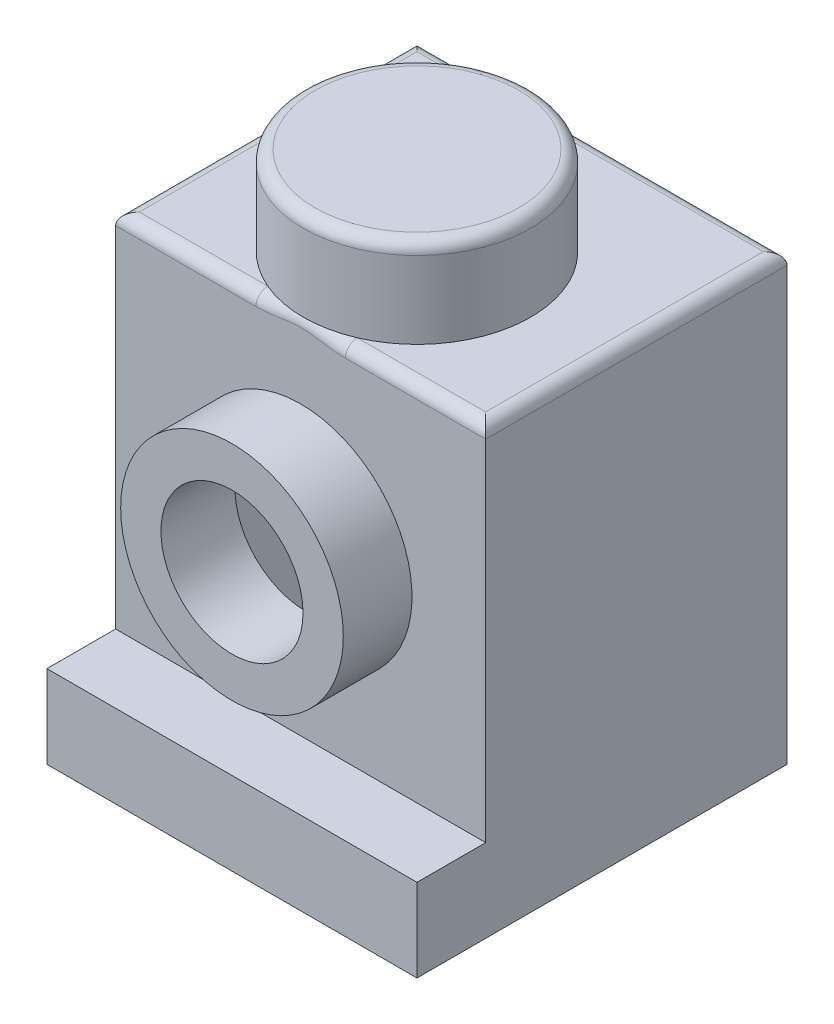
ISO-10303-21;
HEADER;
FILE_DESCRIPTION(('STEP AP214'),'2;1');
FILE_NAME('part.step','',(''),(''),'','','');
FILE_SCHEMA(('AUTOMOTIVE_DESIGN { 1 0 10303 214 1 1 1 1 }'));
ENDSEC;
DATA;
#1=APPLICATION_CONTEXT('core data for automotive mechanical design processes');
#2=APPLICATION_PROTOCOL_DEFINITION('international standard','automotive_design',2000,#1);
#3=PRODUCT_CONTEXT('',#1,'mechanical');
#4=PRODUCT('Part','Part','',(#3));
#5=PRODUCT_RELATED_PRODUCT_CATEGORY('part','',(#4));
#6=PRODUCT_DEFINITION_FORMATION('','',#4);
#7=PRODUCT_DEFINITION_CONTEXT('part definition',#1,'design');
#8=PRODUCT_DEFINITION('design','',#6,#7);
#9=PRODUCT_DEFINITION_SHAPE('','',#8);
#10=(LENGTH_UNIT() NAMED_UNIT(*) SI_UNIT(.MILLI.,.METRE.));
#11=(NAMED_UNIT(*) PLANE_ANGLE_UNIT() SI_UNIT($,.RADIAN.));
#12=(NAMED_UNIT(*) SI_UNIT($,.STERADIAN.) SOLID_ANGLE_UNIT());
#13=UNCERTAINTY_MEASURE_WITH_UNIT(LENGTH_MEASURE(1.E-05),#10,'distance_accuracy_value','');
#14=(GEOMETRIC_REPRESENTATION_CONTEXT(3) GLOBAL_UNCERTAINTY_ASSIGNED_CONTEXT((#13)) GLOBAL_UNIT_ASSIGNED_CONTEXT((#10,
#11,#12)) REPRESENTATION_CONTEXT('',''));
#15=CARTESIAN_POINT('',(0.,0.,0.));
#16=DIRECTION('',(0.,0.,1.));
#17=DIRECTION('',(1.,0.,0.));
#18=AXIS2_PLACEMENT_3D('',#15,#16,#17);
#19=CARTESIAN_POINT('',(-3.96875,1.778,2.49555));
#20=DIRECTION('',(0.,0.,-1.));
#21=DIRECTION('',(-1.,0.,0.));
#22=AXIS2_PLACEMENT_3D('',#19,#20,#21);
#23=PLANE('',#22);
#24=DIRECTION('',(0.,1.,0.));
#25=VECTOR('',#24,1.);
#26=CARTESIAN_POINT('',(3.96875,1.778,2.49555));
#27=LINE('',#26,#25);
#28=CARTESIAN_POINT('',(3.96875,1.778,2.49555));
#29=VERTEX_POINT('',#28);
#30=CARTESIAN_POINT('',(3.96875,9.271,2.49555));
#31=VERTEX_POINT('',#30);
#32=EDGE_CURVE('E316',#29,#31,#27,.T.);
#33=ORIENTED_EDGE('',*,*,#32,.T.);
#34=DIRECTION('',(1.,0.,0.));
#35=VECTOR('',#34,1.);
#36=CARTESIAN_POINT('',(-3.96875,9.271,2.49555));
#37=LINE('',#36,#35);
#38=CARTESIAN_POINT('',(0.959816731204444,9.271,2.49555));
#39=VERTEX_POINT('',#38);
#40=EDGE_CURVE('E277',#31,#39,#37,.F.);
#41=ORIENTED_EDGE('',*,*,#40,.T.);
#42=CARTESIAN_POINT('',(-1.49146617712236,9.52499999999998,2.49555));
#43=CARTESIAN_POINT('',(-1.30289568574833,9.52500000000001,2.49555));
#44=CARTESIAN_POINT('',(-1.24833183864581,9.52500000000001,2.31504621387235));
#45=CARTESIAN_POINT('',(-1.19376799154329,9.52500000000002,2.1345424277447));
#46=CARTESIAN_POINT('',(-1.35076182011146,9.525,2.03008301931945));
#47=CARTESIAN_POINT('',(-1.4914678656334,9.5200397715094,2.49555));
#48=CARTESIAN_POINT('',(-1.30288617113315,9.52668997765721,2.49555));
#49=CARTESIAN_POINT('',(-1.24832138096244,9.52861377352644,2.31504495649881));
#50=CARTESIAN_POINT('',(-1.1937573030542,9.53053713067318,2.1345402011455));
#51=CARTESIAN_POINT('',(-1.35076274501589,9.525,2.03008230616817));
#52=CARTESIAN_POINT('',(-1.49120362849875,9.51508343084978,2.49555));
#53=CARTESIAN_POINT('',(-1.3030619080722,9.52837252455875,2.49555));
#54=CARTESIAN_POINT('',(-1.24855176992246,9.53221852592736,2.31514098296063));
#55=CARTESIAN_POINT('',(-1.19404159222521,9.53606249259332,2.13473192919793));
#56=CARTESIAN_POINT('',(-1.35059701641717,9.525,2.03019268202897));
#57=CARTESIAN_POINT('',(-1.49016142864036,9.50523175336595,2.49555));
#58=CARTESIAN_POINT('',(-1.30370624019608,9.53153870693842,2.49555));
#59=CARTESIAN_POINT('',(-1.24940880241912,9.53919519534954,2.31551594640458));
#60=CARTESIAN_POINT('',(-1.19511091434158,9.54684972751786,2.13548171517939));
#61=CARTESIAN_POINT('',(-1.34994252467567,9.525,2.03062797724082));
#62=CARTESIAN_POINT('',(-1.48938417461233,9.50033634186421,2.49555));
#63=CARTESIAN_POINT('',(-1.304174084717,9.53302184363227,2.49555));
#64=CARTESIAN_POINT('',(-1.25003489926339,9.54256742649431,2.31579463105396));
#65=CARTESIAN_POINT('',(-1.19589467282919,9.55210909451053,2.13603884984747));
#66=CARTESIAN_POINT('',(-1.3494542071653,9.525,2.03095260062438));
#67=CARTESIAN_POINT('',(-1.48633693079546,9.48593317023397,2.49555));
#68=CARTESIAN_POINT('',(-1.30588245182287,9.53686726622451,2.49555));
#69=CARTESIAN_POINT('',(-1.25235867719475,9.55194303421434,2.31687768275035));
#70=CARTESIAN_POINT('',(-1.19883187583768,9.56700602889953,2.13820381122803));
#71=CARTESIAN_POINT('',(-1.34753767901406,9.525,2.0322251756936));
#72=CARTESIAN_POINT('',(-1.4833503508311,9.47657040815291,2.49555));
#73=CARTESIAN_POINT('',(-1.30743048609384,9.53868447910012,2.49555));
#74=CARTESIAN_POINT('',(-1.25450631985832,9.5573153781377,2.31792970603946));
#75=CARTESIAN_POINT('',(-1.20157331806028,9.57593086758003,2.14030419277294));
#76=CARTESIAN_POINT('',(-1.34565725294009,9.525,2.03347229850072));
#77=CARTESIAN_POINT('',(-1.47577862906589,9.45859535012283,2.49555));
#78=CARTESIAN_POINT('',(-1.3103430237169,9.54027220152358,2.49555));
#79=CARTESIAN_POINT('',(-1.2588907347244,9.56561549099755,2.32051275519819));
#80=CARTESIAN_POINT('',(-1.20743020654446,9.59094187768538,2.145470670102));
#81=CARTESIAN_POINT('',(-1.34086898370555,9.525,2.03663273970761));
#82=CARTESIAN_POINT('',(-1.47120163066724,9.44997950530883,2.49555));
#83=CARTESIAN_POINT('',(-1.31170699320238,9.54005968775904,2.49555));
#84=CARTESIAN_POINT('',(-1.26112700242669,9.56855545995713,2.32204133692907));
#85=CARTESIAN_POINT('',(-1.21053798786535,9.59704208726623,2.14852436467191));
#86=CARTESIAN_POINT('',(-1.33796637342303,9.525,2.03854266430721));
#87=CARTESIAN_POINT('',(-1.4607774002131,9.43352869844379,2.49555));
#88=CARTESIAN_POINT('',(-1.31350257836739,9.53787784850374,2.49555));
#89=CARTESIAN_POINT('',(-1.26484582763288,9.57227449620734,2.32540123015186));
#90=CARTESIAN_POINT('',(-1.21617951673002,9.60666170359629,2.15524397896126));
#91=CARTESIAN_POINT('',(-1.33131934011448,9.525,2.04288992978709));
#92=CARTESIAN_POINT('',(-1.45492592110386,9.42569647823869,2.49555));
#93=CARTESIAN_POINT('',(-1.31393495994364,9.53591226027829,2.49555));
#94=CARTESIAN_POINT('',(-1.26632580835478,9.57304621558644,2.32723354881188));
#95=CARTESIAN_POINT('',(-1.21871186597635,9.61018131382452,2.15890613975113));
#96=CARTESIAN_POINT('',(-1.32757210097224,9.525,2.04532903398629));
#97=CARTESIAN_POINT('',(-1.43875300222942,9.40673606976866,2.49555));
#98=CARTESIAN_POINT('',(-1.31339908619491,9.5293510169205,2.49555));
#99=CARTESIAN_POINT('',(-1.2685914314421,9.57295815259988,2.33211543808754));
#100=CARTESIAN_POINT('',(-1.22377155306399,9.6165642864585,2.16865551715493));
#101=CARTESIAN_POINT('',(-1.31714860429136,9.525,2.05206495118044));
#102=CARTESIAN_POINT('',(-1.42775278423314,9.39619020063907,2.49555));
#103=CARTESIAN_POINT('',(-1.3115418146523,9.52390958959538,2.49555));
#104=CARTESIAN_POINT('',(-1.26853625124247,9.57095561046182,2.33527632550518));
#105=CARTESIAN_POINT('',(-1.22554526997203,9.61802754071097,2.17497407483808));
#106=CARTESIAN_POINT('',(-1.31000077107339,9.525,2.05664163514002));
#107=CARTESIAN_POINT('',(-1.40427687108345,9.37690334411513,2.49555));
#108=CARTESIAN_POINT('',(-1.30478677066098,9.51186817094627,2.49555));
#109=CARTESIAN_POINT('',(-1.26544291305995,9.56498111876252,2.34166564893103));
#110=CARTESIAN_POINT('',(-1.22611263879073,9.6181225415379,2.18775170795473));
#111=CARTESIAN_POINT('',(-1.29456943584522,9.525,2.06639029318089));
#112=CARTESIAN_POINT('',(-1.39179740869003,9.3681671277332,2.49555));
#113=CARTESIAN_POINT('',(-1.2999086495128,9.50527567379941,2.49555));
#114=CARTESIAN_POINT('',(-1.26239698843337,9.56100405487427,2.34489423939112));
#115=CARTESIAN_POINT('',(-1.22492554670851,9.61677258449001,2.19420986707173));
#116=CARTESIAN_POINT('',(-1.28628302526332,9.525,2.07156378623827));
#117=CARTESIAN_POINT('',(-1.35634912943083,9.34637664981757,2.49555));
#118=CARTESIAN_POINT('',(-1.28330693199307,9.48715880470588,2.49555));
#119=CARTESIAN_POINT('',(-1.25070133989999,9.54910046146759,2.3536295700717));
#120=CARTESIAN_POINT('',(-1.21820518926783,9.61115485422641,2.21162494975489));
#121=CARTESIAN_POINT('',(-1.26245304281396,9.525,2.08622135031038));
#122=CARTESIAN_POINT('',(-1.332428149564,9.33488526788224,2.49555));
#123=CARTESIAN_POINT('',(-1.26917213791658,9.47547255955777,2.49555));
#124=CARTESIAN_POINT('',(-1.2395760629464,9.54042340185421,2.35906162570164));
#125=CARTESIAN_POINT('',(-1.21016353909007,9.6054860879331,2.2225019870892));
#126=CARTESIAN_POINT('',(-1.24606188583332,9.525,2.096072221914));
#127=CARTESIAN_POINT('',(-1.28325566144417,9.3154460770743,2.49555));
#128=CARTESIAN_POINT('',(-1.23647029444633,9.45388930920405,2.49555));
#129=CARTESIAN_POINT('',(-1.2125663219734,9.52352703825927,2.36947151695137));
#130=CARTESIAN_POINT('',(-1.18885196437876,9.5932863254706,2.24332046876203));
#131=CARTESIAN_POINT('',(-1.21159638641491,9.525,2.11618300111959));
#132=CARTESIAN_POINT('',(-1.25800280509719,9.30750193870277,2.49555));
#133=CARTESIAN_POINT('',(-1.21793441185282,9.44395333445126,2.49555));
#134=CARTESIAN_POINT('',(-1.19667695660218,9.51530821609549,2.37444887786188));
#135=CARTESIAN_POINT('',(-1.17563190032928,9.58675696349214,2.25328952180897));
#136=CARTESIAN_POINT('',(-1.19352032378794,9.525,2.12644332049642));
#137=CARTESIAN_POINT('',(-1.20635734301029,9.29422336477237,2.49555));
#138=CARTESIAN_POINT('',(-1.17781493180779,9.42599959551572,2.49555));
#139=CARTESIAN_POINT('',(-1.16150004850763,9.49988066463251,2.38403637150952));
#140=CARTESIAN_POINT('',(-1.14540330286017,9.57385668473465,2.27246363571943));
#141=CARTESIAN_POINT('',(-1.15571671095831,9.525,2.14722766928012));
#142=CARTESIAN_POINT('',(-1.17995244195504,9.28893800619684,2.49555));
#143=CARTESIAN_POINT('',(-1.15618404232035,9.4179786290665,2.49555));
#144=CARTESIAN_POINT('',(-1.14215694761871,9.4926925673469,2.38863837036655));
#145=CARTESIAN_POINT('',(-1.12835097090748,9.56747679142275,2.28167914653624));
#146=CARTESIAN_POINT('',(-1.13596545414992,9.525,2.15775313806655));
#147=CARTESIAN_POINT('',(-1.12677868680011,9.28058608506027,2.49555));
#148=CARTESIAN_POINT('',(-1.11115464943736,9.40397260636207,2.49555));
#149=CARTESIAN_POINT('',(-1.1013010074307,9.47967432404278,2.39741077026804));
#150=CARTESIAN_POINT('',(-1.09166820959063,9.55544658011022,2.29922423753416));
#151=CARTESIAN_POINT('',(-1.09529892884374,9.525,2.17867828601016));
#152=CARTESIAN_POINT('',(-1.10000942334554,9.27752227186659,2.49555));
#153=CARTESIAN_POINT('',(-1.08774440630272,9.39795934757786,2.49555));
#154=CARTESIAN_POINT('',(-1.07978551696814,9.47384586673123,2.4015806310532));
#155=CARTESIAN_POINT('',(-1.07203902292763,9.54978171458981,2.30757334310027));
#156=CARTESIAN_POINT('',(-1.0743822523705,9.525,2.18907779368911));
#157=CARTESIAN_POINT('',(-1.04618321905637,9.27316484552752,2.49555));
#158=CARTESIAN_POINT('',(-1.03967202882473,9.38770891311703,2.49555));
#159=CARTESIAN_POINT('',(-1.03512990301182,9.46347402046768,2.40954503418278));
#160=CARTESIAN_POINT('',(-1.03080080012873,9.53928860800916,2.32350211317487));
#161=CARTESIAN_POINT('',(-1.03141774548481,9.525,2.20964754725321));
#162=CARTESIAN_POINT('',(-1.01912550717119,9.27188130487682,2.49555));
#163=CARTESIAN_POINT('',(-1.01498681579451,9.38345886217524,2.49555));
#164=CARTESIAN_POINT('',(-1.01198130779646,9.45893805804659,2.41333732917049));
#165=CARTESIAN_POINT('',(-1.00917549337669,9.53445100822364,2.33109403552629));
#166=CARTESIAN_POINT('',(-1.00936420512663,9.525,2.21981617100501));
#167=CARTESIAN_POINT('',(-0.965008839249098,9.27077162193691,2.49555));
#168=CARTESIAN_POINT('',(-0.964894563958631,9.37653001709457,2.49555));
#169=CARTESIAN_POINT('',(-0.964607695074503,9.45107772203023,2.42054978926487));
#170=CARTESIAN_POINT('',(-0.964518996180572,9.52565769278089,2.34551962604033));
#171=CARTESIAN_POINT('',(-0.964349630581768,9.525,2.23973895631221));
#172=CARTESIAN_POINT('',(-0.937949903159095,9.27094426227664,2.49555));
#173=CARTESIAN_POINT('',(-0.939470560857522,9.37383358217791,2.49555));
#174=CARTESIAN_POINT('',(-0.940383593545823,9.44775233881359,2.42397026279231));
#175=CARTESIAN_POINT('',(-0.94147965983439,9.52168976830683,2.35236702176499));
#176=CARTESIAN_POINT('',(-0.9413893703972,9.525,2.24949345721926));
#177=CARTESIAN_POINT('',(-0.846847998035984,9.27348767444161,2.49555));
#178=CARTESIAN_POINT('',(-0.853438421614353,9.36701341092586,2.49555));
#179=CARTESIAN_POINT('',(-0.857421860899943,9.43833789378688,2.4349236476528));
#180=CARTESIAN_POINT('',(-0.862417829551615,9.50978218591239,2.37416206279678));
#181=CARTESIAN_POINT('',(-0.86258759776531,9.525,2.28151442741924));
#182=CARTESIAN_POINT('',(-0.782887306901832,9.27854416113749,2.49555));
#183=CARTESIAN_POINT('',(-0.791110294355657,9.36580405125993,2.49555));
#184=CARTESIAN_POINT('',(-0.796835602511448,9.43469776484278,2.44167588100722));
#185=CARTESIAN_POINT('',(-0.803359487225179,9.503616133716,2.38772393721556));
#186=CARTESIAN_POINT('',(-0.804763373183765,9.525,2.30262804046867));
#187=CARTESIAN_POINT('',(-0.655314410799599,9.29227029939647,2.49555));
#188=CARTESIAN_POINT('',(-0.66543265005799,9.36806407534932,2.49555));
#189=CARTESIAN_POINT('',(-0.673120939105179,9.43146795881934,2.45352029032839));
#190=CARTESIAN_POINT('',(-0.68160317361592,9.49488880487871,2.41141592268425));
#191=CARTESIAN_POINT('',(-0.684958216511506,9.525,2.34106745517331));
#192=CARTESIAN_POINT('',(-0.591703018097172,9.3009462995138,2.49555));
#193=CARTESIAN_POINT('',(-0.601850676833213,9.3714863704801,2.49555));
#194=CARTESIAN_POINT('',(-0.609988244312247,9.43188542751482,2.45860952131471));
#195=CARTESIAN_POINT('',(-0.618709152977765,9.49227094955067,2.42162972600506));
#196=CARTESIAN_POINT('',(-0.622970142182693,9.525,2.35838651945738));
#197=CARTESIAN_POINT('',(-0.464763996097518,9.31931330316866,2.49555));
#198=CARTESIAN_POINT('',(-0.474242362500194,9.38047124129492,2.49555));
#199=CARTESIAN_POINT('',(-0.482128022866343,9.43492413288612,2.46721641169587));
#200=CARTESIAN_POINT('',(-0.490587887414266,9.48936305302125,2.43884421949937));
#201=CARTESIAN_POINT('',(-0.495634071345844,9.525,2.38839163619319));
#202=CARTESIAN_POINT('',(-0.401436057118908,9.32900234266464,2.49555));
#203=CARTESIAN_POINT('',(-0.410008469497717,9.38602555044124,2.49555));
#204=CARTESIAN_POINT('',(-0.417403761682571,9.43754117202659,2.47073704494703));
#205=CARTESIAN_POINT('',(-0.425172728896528,9.48904291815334,2.44590841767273));
#206=CARTESIAN_POINT('',(-0.430292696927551,9.525,2.40108644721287));
#207=CARTESIAN_POINT('',(-0.274572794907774,9.34629483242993,2.49555));
#208=CARTESIAN_POINT('',(-0.28100403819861,9.39648425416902,2.49555));
#209=CARTESIAN_POINT('',(-0.286610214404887,9.44292650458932,2.47624308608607));
#210=CARTESIAN_POINT('',(-0.292583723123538,9.48935213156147,2.45692065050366));
#211=CARTESIAN_POINT('',(-0.296861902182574,9.525,2.42119771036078));
#212=CARTESIAN_POINT('',(-0.211038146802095,9.35390244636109,2.49555));
#213=CARTESIAN_POINT('',(-0.216035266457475,9.40141001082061,2.49555));
#214=CARTESIAN_POINT('',(-0.220543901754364,9.44569448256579,2.47823157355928));
#215=CARTESIAN_POINT('',(-0.225215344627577,9.48997472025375,2.4609097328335));
#216=CARTESIAN_POINT('',(-0.228778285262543,9.525,2.4286247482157));
#217=CARTESIAN_POINT('',(-0.115412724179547,9.36114350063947,2.49555));
#218=CARTESIAN_POINT('',(-0.118180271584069,9.40614101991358,2.49555));
#219=CARTESIAN_POINT('',(-0.120741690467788,9.44839510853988,2.48004400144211));
#220=CARTESIAN_POINT('',(-0.123344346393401,9.49064799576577,2.46453748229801));
#221=CARTESIAN_POINT('',(-0.125427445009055,9.525,2.43541717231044));
#222=CARTESIAN_POINT('',(-0.0834925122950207,9.36286222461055,2.49555));
#223=CARTESIAN_POINT('',(-0.0854955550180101,9.40727745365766,2.49555));
#224=CARTESIAN_POINT('',(-0.0873664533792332,9.44905344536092,2.48045314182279));
#225=CARTESIAN_POINT('',(-0.0892519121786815,9.49082921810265,2.46535618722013));
#226=CARTESIAN_POINT('',(-0.0907826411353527,9.525,2.43695679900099));
#227=CARTESIAN_POINT('',(-0.0196074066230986,9.36465326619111,2.49555));
#228=CARTESIAN_POINT('',(-0.0200873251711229,9.408462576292,2.49555));
#229=CARTESIAN_POINT('',(-0.0205265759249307,9.4497415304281,2.48087730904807));
#230=CARTESIAN_POINT('',(-0.0209800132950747,9.49102040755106,2.46620453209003));
#231=CARTESIAN_POINT('',(-0.0213417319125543,9.525,2.43855408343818));
#232=CARTESIAN_POINT('',(0.0123574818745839,9.36472576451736,2.49555));
#233=CARTESIAN_POINT('',(0.0126622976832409,9.40851232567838,2.49555));
#234=CARTESIAN_POINT('',(0.012938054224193,9.44977134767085,2.48089237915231));
#235=CARTESIAN_POINT('',(0.0132266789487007,9.49103054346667,2.46623493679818));
#236=CARTESIAN_POINT('',(0.0134543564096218,9.525,2.4386119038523));
#237=CARTESIAN_POINT('',(0.108242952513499,9.36238672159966,2.49555));
#238=CARTESIAN_POINT('',(0.110855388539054,9.40695900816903,2.49555));
#239=CARTESIAN_POINT('',(0.113267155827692,9.4488667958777,2.48034481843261));
#240=CARTESIAN_POINT('',(0.115727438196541,9.49077356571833,2.46513887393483));
#241=CARTESIAN_POINT('',(0.117697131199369,9.525,2.43654677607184));
#242=CARTESIAN_POINT('',(0.17209912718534,9.35741411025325,2.49555));
#243=CARTESIAN_POINT('',(0.176307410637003,9.40364454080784,2.49555));
#244=CARTESIAN_POINT('',(0.180008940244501,9.44693665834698,2.47918836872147));
#245=CARTESIAN_POINT('',(0.183969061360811,9.49021757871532,2.46281896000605));
#246=CARTESIAN_POINT('',(0.186937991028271,9.525,2.43218128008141));
#247=CARTESIAN_POINT('',(0.299527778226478,9.3433981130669,2.49555));
#248=CARTESIAN_POINT('',(0.306363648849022,9.39473537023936,2.49555));
#249=CARTESIAN_POINT('',(0.312416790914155,9.44201848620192,2.47532825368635));
#250=CARTESIAN_POINT('',(0.318733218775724,9.48929342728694,2.45509907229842));
#251=CARTESIAN_POINT('',(0.323290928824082,9.525,2.41785428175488));
#252=CARTESIAN_POINT('',(0.363098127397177,9.33433867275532,2.49555));
#253=CARTESIAN_POINT('',(0.371166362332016,9.38910844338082,2.49555));
#254=CARTESIAN_POINT('',(0.378077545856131,9.43902628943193,2.47261847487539));
#255=CARTESIAN_POINT('',(0.385454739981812,9.48892530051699,2.44966238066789));
#256=CARTESIAN_POINT('',(0.390393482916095,9.525,2.40787067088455));
#257=CARTESIAN_POINT('',(0.490151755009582,9.31571834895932,2.49555));
#258=CARTESIAN_POINT('',(0.499783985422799,9.37861871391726,2.49555));
#259=CARTESIAN_POINT('',(0.507852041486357,9.43420772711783,2.46566068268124));
#260=CARTESIAN_POINT('',(0.516391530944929,9.48978077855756,2.43574567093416));
#261=CARTESIAN_POINT('',(0.521419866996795,9.525,2.38293037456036));
#262=CARTESIAN_POINT('',(0.553635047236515,9.30615755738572,2.49555));
#263=CARTESIAN_POINT('',(0.5638038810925,9.37374404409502,2.49555));
#264=CARTESIAN_POINT('',(0.57196606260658,9.43238114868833,2.46141295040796));
#265=CARTESIAN_POINT('',(0.580804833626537,9.49101708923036,2.42722111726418));
#266=CARTESIAN_POINT('',(0.585344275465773,9.525,2.36797459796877));
#267=CARTESIAN_POINT('',(0.64034953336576,9.2946673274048,2.49555));
#268=CARTESIAN_POINT('',(0.649972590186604,9.36934911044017,2.49555));
#269=CARTESIAN_POINT('',(0.657959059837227,9.43198871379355,2.45453086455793));
#270=CARTESIAN_POINT('',(0.66603498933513,9.49462720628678,2.41350480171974));
#271=CARTESIAN_POINT('',(0.669879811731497,9.525,2.34469643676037));
#272=CARTESIAN_POINT('',(0.663444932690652,9.29175807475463,2.49555));
#273=CARTESIAN_POINT('',(0.672926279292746,9.3683929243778,2.49555));
#274=CARTESIAN_POINT('',(0.680709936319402,9.43208656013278,2.452593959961));
#275=CARTESIAN_POINT('',(0.688593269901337,9.49578161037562,2.40962893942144));
#276=CARTESIAN_POINT('',(0.692127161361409,9.525,2.33822231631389));
#277=CARTESIAN_POINT('',(0.709662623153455,9.28636223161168,2.49555));
#278=CARTESIAN_POINT('',(0.718648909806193,9.36703004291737,2.49555));
#279=CARTESIAN_POINT('',(0.725876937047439,9.4327753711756,2.44850409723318));
#280=CARTESIAN_POINT('',(0.733204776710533,9.49852232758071,2.40144911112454));
#281=CARTESIAN_POINT('',(0.736076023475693,9.525,2.3247610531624));
#282=CARTESIAN_POINT('',(0.732784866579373,9.28387523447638,2.49555));
#283=CARTESIAN_POINT('',(0.74142885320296,9.36662490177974,2.49555));
#284=CARTESIAN_POINT('',(0.748293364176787,9.43336585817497,2.44635135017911));
#285=CARTESIAN_POINT('',(0.755267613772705,9.50011083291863,2.39714158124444));
#286=CARTESIAN_POINT('',(0.757778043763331,9.525,2.31777441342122));
#287=CARTESIAN_POINT('',(0.802394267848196,9.27721823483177,2.49555));
#288=CARTESIAN_POINT('',(0.809796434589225,9.36641118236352,2.49555));
#289=CARTESIAN_POINT('',(0.815143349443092,9.43601403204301,2.43953985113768));
#290=CARTESIAN_POINT('',(0.820937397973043,9.50563525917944,2.38348401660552));
#291=CARTESIAN_POINT('',(0.822203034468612,9.525,2.29604791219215));
#292=CARTESIAN_POINT('',(0.848963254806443,9.27387531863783,2.49555));
#293=CARTESIAN_POINT('',(0.854976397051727,9.36763583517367,2.49555));
#294=CARTESIAN_POINT('',(0.859017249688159,9.43895040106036,2.43454050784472));
#295=CARTESIAN_POINT('',(0.863590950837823,9.51031769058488,2.37346402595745));
#296=CARTESIAN_POINT('',(0.864087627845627,9.525,2.28058522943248));
#297=CARTESIAN_POINT('',(0.950100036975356,9.27021994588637,2.49555));
#298=CARTESIAN_POINT('',(0.951474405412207,9.37434880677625,2.49555));
#299=CARTESIAN_POINT('',(0.951733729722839,9.44866960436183,2.42262040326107));
#300=CARTESIAN_POINT('',(0.952720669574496,9.52307038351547,2.34959546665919));
#301=CARTESIAN_POINT('',(0.952183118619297,9.525,2.24538322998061));
#302=CARTESIAN_POINT('',(1.00470159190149,9.27050860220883,2.49555));
#303=CARTESIAN_POINT('',(1.00257591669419,9.38059051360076,2.49555));
#304=CARTESIAN_POINT('',(1.00017827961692,9.45601414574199,2.41551808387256));
#305=CARTESIAN_POINT('',(0.998626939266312,9.53162811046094,2.33533771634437));
#306=CARTESIAN_POINT('',(0.997944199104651,9.525,2.22536134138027));
#307=CARTESIAN_POINT('',(1.08616822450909,9.27617447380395,2.49555));
#308=CARTESIAN_POINT('',(1.07550826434,9.39508879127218,2.49555));
#309=CARTESIAN_POINT('',(1.06847569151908,9.47100469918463,2.40368211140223));
#310=CARTESIAN_POINT('',(1.06165848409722,9.54696556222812,2.31177780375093));
#311=CARTESIAN_POINT('',(1.06345287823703,9.525,2.19441260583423));
#312=CARTESIAN_POINT('',(1.11321128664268,9.27892728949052,2.49555));
#313=CARTESIAN_POINT('',(1.09936247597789,9.40083110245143,2.49555));
#314=CARTESIAN_POINT('',(1.09048378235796,9.47665251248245,2.39954672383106));
#315=CARTESIAN_POINT('',(1.08182953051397,9.5525410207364,2.30349736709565));
#316=CARTESIAN_POINT('',(1.08473763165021,9.525,2.18395991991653));
#317=CARTESIAN_POINT('',(1.16699999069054,9.2866186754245,2.49555));
#318=CARTESIAN_POINT('',(1.14540043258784,9.41430484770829,2.49555));
#319=CARTESIAN_POINT('',(1.13244213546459,9.48934216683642,2.39083688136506));
#320=CARTESIAN_POINT('',(1.11970763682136,9.56444795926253,2.28607679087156));
#321=CARTESIAN_POINT('',(1.12617108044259,9.525,2.1628850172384));
#322=CARTESIAN_POINT('',(1.19374570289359,9.2915567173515,2.49555));
#323=CARTESIAN_POINT('',(1.16759574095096,9.42206582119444,2.49555));
#324=CARTESIAN_POINT('',(1.15239289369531,9.49638367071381,2.38626253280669));
#325=CARTESIAN_POINT('',(1.13741270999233,9.57079496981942,2.27691652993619));
#326=CARTESIAN_POINT('',(1.14632004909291,9.525,2.15226284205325));
#327=CARTESIAN_POINT('',(1.23771888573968,9.30208573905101,2.49555));
#328=CARTESIAN_POINT('',(1.20225932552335,9.43671189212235,2.49555));
#329=CARTESIAN_POINT('',(1.18304163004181,9.50915336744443,2.37825468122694));
#330=CARTESIAN_POINT('',(1.16392422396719,9.58163617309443,2.26093339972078));
#331=CARTESIAN_POINT('',(1.17873102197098,9.525,2.13462068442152));
#332=CARTESIAN_POINT('',(1.25513056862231,9.30690246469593,2.49555));
#333=CARTESIAN_POINT('',(1.21553977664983,9.4430519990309,2.49555));
#334=CARTESIAN_POINT('',(1.19459891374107,9.51453012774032,2.37495300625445));
#335=CARTESIAN_POINT('',(1.17375256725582,9.58605774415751,2.25432585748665));
#336=CARTESIAN_POINT('',(1.19137202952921,9.525,2.12758723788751));
#337=CARTESIAN_POINT('',(1.28947828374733,9.31799495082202,2.49555));
#338=CARTESIAN_POINT('',(1.24046084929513,9.45661606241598,2.49555));
#339=CARTESIAN_POINT('',(1.21588534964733,9.52567310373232,2.368138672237));
#340=CARTESIAN_POINT('',(1.19140420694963,9.59477952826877,2.24069703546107));
#341=CARTESIAN_POINT('',(1.21594833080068,9.525,2.11363745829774));
#342=CARTESIAN_POINT('',(1.30641469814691,9.32426949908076,2.49555));
#343=CARTESIAN_POINT('',(1.25209681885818,9.46385189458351,2.49555));
#344=CARTESIAN_POINT('',(1.22561600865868,9.53143899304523,2.36462619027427));
#345=CARTESIAN_POINT('',(1.19921736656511,9.59908178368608,2.23366767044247));
#346=CARTESIAN_POINT('',(1.22788420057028,9.525,2.10672103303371));
#347=CARTESIAN_POINT('',(1.33967369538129,9.33862935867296,2.49555));
#348=CARTESIAN_POINT('',(1.27317936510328,9.47904191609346,2.49555));
#349=CARTESIAN_POINT('',(1.24269397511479,9.54302293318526,2.35737690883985));
#350=CARTESIAN_POINT('',(1.21229217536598,9.60706069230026,2.21916816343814));
#351=CARTESIAN_POINT('',(1.25099231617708,9.525,2.09308247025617));
#352=CARTESIAN_POINT('',(1.3559903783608,9.34672857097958,2.49555));
#353=CARTESIAN_POINT('',(1.28259167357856,9.48701247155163,2.49555));
#354=CARTESIAN_POINT('',(1.25002186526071,9.54884103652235,2.353638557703));
#355=CARTESIAN_POINT('',(1.21751122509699,9.61072800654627,2.21168677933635));
#356=CARTESIAN_POINT('',(1.26215779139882,9.525,2.08636229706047));
#357=CARTESIAN_POINT('',(1.38737153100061,9.36509059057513,2.49555));
#358=CARTESIAN_POINT('',(1.29815695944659,9.50296419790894,2.49555));
#359=CARTESIAN_POINT('',(1.2612842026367,9.5596016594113,2.34603439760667));
#360=CARTESIAN_POINT('',(1.2244704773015,9.61629363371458,2.19647932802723));
#361=CARTESIAN_POINT('',(1.28334182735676,9.525,2.07339850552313));
#362=CARTESIAN_POINT('',(1.40243828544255,9.37534932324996,2.49555));
#363=CARTESIAN_POINT('',(1.30428608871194,9.51095007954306,2.49555));
#364=CARTESIAN_POINT('',(1.26522497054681,9.56454579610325,2.34216884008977));
#365=CARTESIAN_POINT('',(1.22618243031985,9.61817816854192,2.18874672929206));
#366=CARTESIAN_POINT('',(1.29336249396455,9.525,2.06715401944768));
#367=CARTESIAN_POINT('',(1.42496018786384,9.39392338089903,2.49555));
#368=CARTESIAN_POINT('',(1.31071722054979,9.52245572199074,2.49555));
#369=CARTESIAN_POINT('',(1.26815312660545,9.57022440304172,2.33603462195));
#370=CARTESIAN_POINT('',(1.22559706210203,9.61800827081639,2.17650366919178));
#371=CARTESIAN_POINT('',(1.30816410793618,9.525,2.05780114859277));
#372=CARTESIAN_POINT('',(1.43308398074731,9.40142428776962,2.49555));
#373=CARTESIAN_POINT('',(1.31235598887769,9.52650847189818,2.49555));
#374=CARTESIAN_POINT('',(1.26847663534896,9.57184931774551,2.33373393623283));
#375=CARTESIAN_POINT('',(1.22459396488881,9.6171950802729,2.17190332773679));
#376=CARTESIAN_POINT('',(1.31345927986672,9.525,2.05442291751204));
#377=CARTESIAN_POINT('',(1.44824298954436,9.41746905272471,2.49555));
#378=CARTESIAN_POINT('',(1.31397541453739,9.53334906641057,2.49555));
#379=CARTESIAN_POINT('',(1.26753837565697,9.57331816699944,2.32927946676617));
#380=CARTESIAN_POINT('',(1.22109857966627,9.61329186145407,2.16299463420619));
#381=CARTESIAN_POINT('',(1.32327615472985,9.525,2.04811343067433));
#382=CARTESIAN_POINT('',(1.45527892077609,9.42601221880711,2.49555));
#383=CARTESIAN_POINT('',(1.31394608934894,9.5361283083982,2.49555));
#384=CARTESIAN_POINT('',(1.26627765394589,9.57316327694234,2.32712558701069));
#385=CARTESIAN_POINT('',(1.21859819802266,9.6101892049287,2.15868955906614));
#386=CARTESIAN_POINT('',(1.32779836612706,9.525,2.04518188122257));
#387=CARTESIAN_POINT('',(1.46692100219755,9.44281147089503,2.49555));
#388=CARTESIAN_POINT('',(1.31262800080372,9.53937567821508,2.49555));
#389=CARTESIAN_POINT('',(1.26284649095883,9.57046115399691,2.32343858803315));
#390=CARTESIAN_POINT('',(1.21305713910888,9.60154076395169,2.15131855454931));
#391=CARTESIAN_POINT('',(1.33524232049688,9.525,2.04032824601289));
#392=CARTESIAN_POINT('',(1.47173251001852,9.45092377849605,2.49555));
#393=CARTESIAN_POINT('',(1.31152026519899,9.54011629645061,2.49555));
#394=CARTESIAN_POINT('',(1.26083780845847,9.56827044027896,2.3218607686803));
#395=CARTESIAN_POINT('',(1.2101465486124,9.59641033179,2.14816584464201));
#396=CARTESIAN_POINT('',(1.33830177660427,9.525,2.03832102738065));
#397=CARTESIAN_POINT('',(1.47994800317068,9.46782270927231,2.49555));
#398=CARTESIAN_POINT('',(1.30888263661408,9.53974649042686,2.49555));
#399=CARTESIAN_POINT('',(1.25662612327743,9.56166102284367,2.31910270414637));
#400=CARTESIAN_POINT('',(1.20436096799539,9.58356243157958,2.14264967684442));
#401=CARTESIAN_POINT('',(1.34350890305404,9.525,2.03489265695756));
#402=CARTESIAN_POINT('',(1.48335583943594,9.4766074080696,2.49555));
#403=CARTESIAN_POINT('',(1.30735366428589,9.53863372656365,2.49555));
#404=CARTESIAN_POINT('',(1.25442367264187,9.55724848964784,2.31792137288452));
#405=CARTESIAN_POINT('',(1.20148932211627,9.57584871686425,2.14029044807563));
#406=CARTESIAN_POINT('',(1.34565906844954,9.525,2.03346990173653));
#407=CARTESIAN_POINT('',(1.48772939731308,9.49201157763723,2.49555));
#408=CARTESIAN_POINT('',(1.30513580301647,9.53533605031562,2.49555));
#409=CARTESIAN_POINT('',(1.25133244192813,9.54808265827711,2.31638541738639));
#410=CARTESIAN_POINT('',(1.19752619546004,9.56082185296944,2.13721949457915));
#411=CARTESIAN_POINT('',(1.34841404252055,9.525,2.03164369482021));
#412=CARTESIAN_POINT('',(1.48911800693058,9.4985119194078,2.49555));
#413=CARTESIAN_POINT('',(1.30433289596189,9.53355892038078,2.49555));
#414=CARTESIAN_POINT('',(1.25024783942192,9.54380741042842,2.31589001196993));
#415=CARTESIAN_POINT('',(1.19616158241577,9.55405218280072,2.13622944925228));
#416=CARTESIAN_POINT('',(1.34928699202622,9.525,2.03106376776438));
#417=CARTESIAN_POINT('',(1.49099226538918,9.51167149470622,2.49555));
#418=CARTESIAN_POINT('',(1.30319634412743,9.52953633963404,2.49555));
#419=CARTESIAN_POINT('',(1.24872957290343,9.5347065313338,2.31521729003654));
#420=CARTESIAN_POINT('',(1.19426244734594,9.53987110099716,2.13488446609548));
#421=CARTESIAN_POINT('',(1.35046433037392,9.525,2.03028096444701));
#422=CARTESIAN_POINT('',(1.49147366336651,9.51833132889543,2.49555));
#423=CARTESIAN_POINT('',(1.30286595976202,9.52729024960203,2.49555));
#424=CARTESIAN_POINT('',(1.24829897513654,9.52987842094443,2.31504147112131));
#425=CARTESIAN_POINT('',(1.19373363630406,9.53246320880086,2.13453384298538));
#426=CARTESIAN_POINT('',(1.35076604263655,9.525,2.03007986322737));
#427=CARTESIAN_POINT('',(1.49146617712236,9.52500000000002,2.49555));
#428=CARTESIAN_POINT('',(1.30289568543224,9.52499999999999,2.49555));
#429=CARTESIAN_POINT('',(1.24833183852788,9.52499999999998,2.31504621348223));
#430=CARTESIAN_POINT('',(1.19376799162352,9.52499999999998,2.13454242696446));
#431=CARTESIAN_POINT('',(1.35076182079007,9.525,2.03008301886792));
#432=(BOUNDED_SURFACE() B_SPLINE_SURFACE(3,2,((#42,#43,#44,#45,#46),(#47,#48,#49,#50,#51),(#52,
#53,#54,#55,#56),(#57,#58,#59,#60,#61),(#62,#63,#64,#65,#66),(#67,#68,#69,#70,#71),(#72,#73,#74,
#75,#76),(#77,#78,#79,#80,#81),(#82,#83,#84,#85,#86),(#87,#88,#89,#90,#91),(#92,#93,#94,#95,
#96),(#97,#98,#99,#100,#101),(#102,#103,#104,#105,#106),(#107,#108,#109,#110,#111),(#112,#113,
#114,#115,#116),(#117,#118,#119,#120,#121),(#122,#123,#124,#125,#126),(#127,#128,#129,#130,
#131),(#132,#133,#134,#135,#136),(#137,#138,#139,#140,#141),(#142,#143,#144,#145,#146),(#147,
#148,#149,#150,#151),(#152,#153,#154,#155,#156),(#157,#158,#159,#160,#161),(#162,#163,#164,#165,
#166),(#167,#168,#169,#170,#171),(#172,#173,#174,#175,#176),(#177,#178,#179,#180,#181),(#182,
#183,#184,#185,#186),(#187,#188,#189,#190,#191),(#192,#193,#194,#195,#196),(#197,#198,#199,#200,
#201),(#202,#203,#204,#205,#206),(#207,#208,#209,#210,#211),(#212,#213,#214,#215,#216),(#217,
#218,#219,#220,#221),(#222,#223,#224,#225,#226),(#227,#228,#229,#230,#231),(#232,#233,#234,#235,
#236),(#237,#238,#239,#240,#241),(#242,#243,#244,#245,#246),(#247,#248,#249,#250,#251),(#252,
#253,#254,#255,#256),(#257,#258,#259,#260,#261),(#262,#263,#264,#265,#266),(#267,#268,#269,#270,
#271),(#272,#273,#274,#275,#276),(#277,#278,#279,#280,#281),(#282,#283,#284,#285,#286),(#287,
#288,#289,#290,#291),(#292,#293,#294,#295,#296),(#297,#298,#299,#300,#301),(#302,#303,#304,#305,
#306),(#307,#308,#309,#310,#311),(#312,#313,#314,#315,#316),(#317,#318,#319,#320,#321),(#322,
#323,#324,#325,#326),(#327,#328,#329,#330,#331),(#332,#333,#334,#335,#336),(#337,#338,#339,#340,
#341),(#342,#343,#344,#345,#346),(#347,#348,#349,#350,#351),(#352,#353,#354,#355,#356),(#357,
#358,#359,#360,#361),(#362,#363,#364,#365,#366),(#367,#368,#369,#370,#371),(#372,#373,#374,#375,
#376),(#377,#378,#379,#380,#381),(#382,#383,#384,#385,#386),(#387,#388,#389,#390,#391),(#392,
#393,#394,#395,#396),(#397,#398,#399,#400,#401),(#402,#403,#404,#405,#406),(#407,#408,#409,#410,
#411),(#412,#413,#414,#415,#416),(#417,#418,#419,#420,#421),(#422,#423,#424,#425,#426),(#427,
#428,#429,#430,#431)),.UNSPECIFIED.,.F.,.F.,.F.) B_SPLINE_SURFACE_WITH_KNOTS((4,2,2,2,2,2,2,2,2,
2,2,2,2,2,2,2,2,2,2,2,2,2,2,2,2,2,2,2,2,2,2,2,2,2,2,2,2,2,4),(3,2,3),(0.,0.0148664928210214,
0.0297124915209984,0.0589981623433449,0.0881360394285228,0.117372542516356,0.162830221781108,
0.20840626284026,0.287572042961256,0.366819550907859,0.447480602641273,0.528241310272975,
0.609457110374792,0.690605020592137,0.882845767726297,1.07542512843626,1.26763781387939,
1.4594631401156,1.55532300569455,1.65117234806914,1.84303626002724,2.03566053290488,
2.22824961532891,2.29807972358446,2.36784219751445,2.50785413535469,2.67130866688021,
2.75279410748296,2.83425985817,2.88840686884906,2.94250901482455,2.99703817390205,
3.05146535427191,3.08455854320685,3.11762987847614,3.14581941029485,3.17393108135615,
3.1938118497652,3.21378554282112),(0.,0.5,1.),
.UNSPECIFIED.) GEOMETRIC_REPRESENTATION_ITEM() RATIONAL_B_SPLINE_SURFACE(((1.,0.802918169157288,
1.,0.802918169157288,1.),(1.,0.802916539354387,1.,0.802916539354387,1.),(1.,0.803034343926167,
1.,0.803034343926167,1.),(1.,0.803493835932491,1.,0.803493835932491,1.),(1.,0.803835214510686,
1.,0.803835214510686,1.),(1.,0.805160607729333,1.,0.805160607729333,1.),(1.,0.806446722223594,
1.,0.806446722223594,1.),(1.,0.809593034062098,1.,0.809593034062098,1.),(1.,0.8114503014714,1.,
0.8114503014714,1.),(1.,0.815515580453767,1.,0.815515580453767,1.),(1.,0.817724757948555,1.,
0.817724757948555,1.),(1.,0.823584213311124,1.,0.823584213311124,1.),(1.,0.827353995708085,1.,
0.827353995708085,1.),(1.,0.834920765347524,1.,0.834920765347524,1.),(1.,0.838717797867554,1.,
0.838717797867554,1.),(1.,0.848923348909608,1.,0.848923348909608,1.),(1.,0.855194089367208,1.,
0.855194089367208,1.),(1.,0.86709282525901,1.,0.86709282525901,1.),(1.,0.872720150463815,1.,
0.872720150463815,1.),(1.,0.883467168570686,1.,0.883467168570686,1.),(1.,0.888576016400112,1.,
0.888576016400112,1.),(1.,0.8982404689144,1.,0.8982404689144,1.),(1.,0.902795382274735,1.,
0.902795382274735,1.),(1.,0.911437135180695,1.,0.911437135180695,1.),(1.,0.915521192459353,1.,
0.915521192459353,1.),(1.,0.923242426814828,1.,0.923242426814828,1.),(1.,0.926879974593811,1.,
0.926879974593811,1.),(1.,0.938468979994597,1.,0.938468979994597,1.),(1.,0.945508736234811,1.,
0.945508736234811,1.),(1.,0.957758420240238,1.,0.957758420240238,1.),(1.,0.962965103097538,1.,
0.962965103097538,1.),(1.,0.971722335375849,1.,0.971722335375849,1.),(1.,0.975276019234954,1.,
0.975276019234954,1.),(1.,0.980816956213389,1.,0.980816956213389,1.),(1.,0.982807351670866,1.,
0.982807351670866,1.),(1.,0.984620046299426,1.,0.984620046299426,1.),(1.,0.985028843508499,1.,
0.985028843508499,1.),(1.,0.985452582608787,1.,0.985452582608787,1.),(1.,0.985467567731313,1.,
0.985467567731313,1.),(1.,0.98492076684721,1.,0.98492076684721,1.),(1.,0.983766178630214,1.,
0.983766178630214,1.),(1.,0.979896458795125,1.,0.979896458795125,1.),(1.,0.977175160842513,1.,
0.977175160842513,1.),(1.,0.970141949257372,1.,0.970141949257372,1.),(1.,0.965830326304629,1.,
0.965830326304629,1.),(1.,0.958778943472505,1.,0.958778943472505,1.),(1.,0.956789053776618,1.,
0.956789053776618,1.),(1.,0.952572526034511,1.,0.952572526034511,1.),(1.,0.95034611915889,1.,
0.95034611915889,1.),(1.,0.943274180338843,1.,0.943274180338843,1.),(1.,0.938048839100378,1.,
0.938048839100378,1.),(1.,0.925464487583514,1.,0.925464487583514,1.),(1.,0.917894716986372,1.,
0.917894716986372,1.),(1.,0.905083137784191,1.,0.905083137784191,1.),(1.,0.900577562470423,1.,
0.900577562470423,1.),(1.,0.891007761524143,1.,0.891007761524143,1.),(1.,0.885943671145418,1.,
0.885943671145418,1.),(1.,0.876992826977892,1.,0.876992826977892,1.),(1.,0.873280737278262,1.,
0.873280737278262,1.),(1.,0.865566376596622,1.,0.865566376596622,1.),(1.,0.861564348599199,1.,
0.861564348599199,1.),(1.,0.853242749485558,1.,0.853242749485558,1.),(1.,0.848920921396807,1.,
0.848920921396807,1.),(1.,0.840057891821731,1.,0.840057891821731,1.),(1.,0.835517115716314,1.,
0.835517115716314,1.),(1.,0.828251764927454,1.,0.828251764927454,1.),(1.,0.825512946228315,1.,
0.825512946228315,1.),(1.,0.820184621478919,1.,0.820184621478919,1.),(1.,0.817595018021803,1.,
0.817595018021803,1.),(1.,0.813143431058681,1.,0.813143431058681,1.),(1.,0.811230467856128,1.,
0.811230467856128,1.),(1.,0.807877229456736,1.,0.807877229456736,1.),(1.,0.806435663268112,1.,
0.806435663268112,1.),(1.,0.804558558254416,1.,0.804558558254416,1.),(1.,0.80395204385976,1.,
0.80395204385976,1.),(1.,0.803127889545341,1.,0.803127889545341,1.),(1.,0.802912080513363,1.,
0.802912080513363,1.),(1.,0.802918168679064,1.,0.802918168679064,1.))) REPRESENTATION_ITEM('') SURFACE());
#433=CARTESIAN_POINT('',(1.49146617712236,9.52500000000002,2.49555));
#434=CARTESIAN_POINT('',(1.49147366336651,9.51833132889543,2.49555));
#435=CARTESIAN_POINT('',(1.49099226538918,9.51167149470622,2.49555));
#436=CARTESIAN_POINT('',(1.48911800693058,9.4985119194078,2.49555));
#437=CARTESIAN_POINT('',(1.48772939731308,9.49201157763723,2.49555));
#438=CARTESIAN_POINT('',(1.48335583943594,9.4766074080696,2.49555));
#439=CARTESIAN_POINT('',(1.47994800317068,9.46782270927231,2.49555));
#440=CARTESIAN_POINT('',(1.47173251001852,9.45092377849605,2.49555));
#441=CARTESIAN_POINT('',(1.46692100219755,9.44281147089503,2.49555));
#442=CARTESIAN_POINT('',(1.45527892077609,9.42601221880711,2.49555));
#443=CARTESIAN_POINT('',(1.44824298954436,9.41746905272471,2.49555));
#444=CARTESIAN_POINT('',(1.43308398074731,9.40142428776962,2.49555));
#445=CARTESIAN_POINT('',(1.42496018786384,9.39392338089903,2.49555));
#446=CARTESIAN_POINT('',(1.40243828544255,9.37534932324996,2.49555));
#447=CARTESIAN_POINT('',(1.38737153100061,9.36509059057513,2.49555));
#448=CARTESIAN_POINT('',(1.3559903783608,9.34672857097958,2.49555));
#449=CARTESIAN_POINT('',(1.33967369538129,9.33862935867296,2.49555));
#450=CARTESIAN_POINT('',(1.30641469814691,9.32426949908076,2.49555));
#451=CARTESIAN_POINT('',(1.28947828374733,9.31799495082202,2.49555));
#452=CARTESIAN_POINT('',(1.25513056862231,9.30690246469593,2.49555));
#453=CARTESIAN_POINT('',(1.23771888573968,9.30208573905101,2.49555));
#454=CARTESIAN_POINT('',(1.19374570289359,9.2915567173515,2.49555));
#455=CARTESIAN_POINT('',(1.16699999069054,9.2866186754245,2.49555));
#456=CARTESIAN_POINT('',(1.11321128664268,9.27892728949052,2.49555));
#457=CARTESIAN_POINT('',(1.08616822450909,9.27617447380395,2.49555));
#458=CARTESIAN_POINT('',(1.00470159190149,9.27050860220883,2.49555));
#459=CARTESIAN_POINT('',(0.950100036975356,9.27021994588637,2.49555));
#460=CARTESIAN_POINT('',(0.848963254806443,9.27387531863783,2.49555));
#461=CARTESIAN_POINT('',(0.802394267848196,9.27721823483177,2.49555));
#462=CARTESIAN_POINT('',(0.732784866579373,9.28387523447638,2.49555));
#463=CARTESIAN_POINT('',(0.709662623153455,9.28636223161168,2.49555));
#464=CARTESIAN_POINT('',(0.663444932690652,9.29175807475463,2.49555));
#465=CARTESIAN_POINT('',(0.64034953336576,9.2946673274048,2.49555));
#466=CARTESIAN_POINT('',(0.553635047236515,9.30615755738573,2.49555));
#467=CARTESIAN_POINT('',(0.490151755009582,9.31571834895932,2.49555));
#468=CARTESIAN_POINT('',(0.363098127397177,9.33433867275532,2.49555));
#469=CARTESIAN_POINT('',(0.299527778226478,9.3433981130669,2.49555));
#470=CARTESIAN_POINT('',(0.17209912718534,9.35741411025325,2.49555));
#471=CARTESIAN_POINT('',(0.1082429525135,9.36238672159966,2.49555));
#472=CARTESIAN_POINT('',(0.0123574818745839,9.36472576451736,2.49555));
#473=CARTESIAN_POINT('',(-0.0196074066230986,9.36465326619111,2.49555));
#474=CARTESIAN_POINT('',(-0.0834925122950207,9.36286222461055,2.49555));
#475=CARTESIAN_POINT('',(-0.115412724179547,9.36114350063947,2.49555));
#476=CARTESIAN_POINT('',(-0.211038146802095,9.35390244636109,2.49555));
#477=CARTESIAN_POINT('',(-0.274572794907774,9.34629483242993,2.49555));
#478=CARTESIAN_POINT('',(-0.401436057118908,9.32900234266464,2.49555));
#479=CARTESIAN_POINT('',(-0.464763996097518,9.31931330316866,2.49555));
#480=CARTESIAN_POINT('',(-0.591703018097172,9.3009462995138,2.49555));
#481=CARTESIAN_POINT('',(-0.655314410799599,9.29227029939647,2.49555));
#482=CARTESIAN_POINT('',(-0.782887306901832,9.27854416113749,2.49555));
#483=CARTESIAN_POINT('',(-0.846847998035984,9.27348767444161,2.49555));
#484=CARTESIAN_POINT('',(-0.937949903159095,9.27094426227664,2.49555));
#485=CARTESIAN_POINT('',(-0.965008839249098,9.27077162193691,2.49555));
#486=CARTESIAN_POINT('',(-1.01912550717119,9.27188130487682,2.49555));
#487=CARTESIAN_POINT('',(-1.04618321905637,9.27316484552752,2.49555));
#488=CARTESIAN_POINT('',(-1.10000942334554,9.27752227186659,2.49555));
#489=CARTESIAN_POINT('',(-1.12677868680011,9.28058608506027,2.49555));
#490=CARTESIAN_POINT('',(-1.17995244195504,9.28893800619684,2.49555));
#491=CARTESIAN_POINT('',(-1.20635734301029,9.29422336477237,2.49555));
#492=CARTESIAN_POINT('',(-1.25800280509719,9.30750193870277,2.49555));
#493=CARTESIAN_POINT('',(-1.28325566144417,9.31544607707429,2.49555));
#494=CARTESIAN_POINT('',(-1.332428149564,9.33488526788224,2.49555));
#495=CARTESIAN_POINT('',(-1.35634912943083,9.34637664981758,2.49555));
#496=CARTESIAN_POINT('',(-1.39179740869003,9.3681671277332,2.49555));
#497=CARTESIAN_POINT('',(-1.40427687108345,9.37690334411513,2.49555));
#498=CARTESIAN_POINT('',(-1.42775278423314,9.39619020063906,2.49555));
#499=CARTESIAN_POINT('',(-1.43875300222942,9.40673606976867,2.49555));
#500=CARTESIAN_POINT('',(-1.45492592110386,9.42569647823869,2.49555));
#501=CARTESIAN_POINT('',(-1.4607774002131,9.43352869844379,2.49555));
#502=CARTESIAN_POINT('',(-1.47120163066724,9.44997950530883,2.49555));
#503=CARTESIAN_POINT('',(-1.47577862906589,9.45859535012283,2.49555));
#504=CARTESIAN_POINT('',(-1.4833503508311,9.47657040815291,2.49555));
#505=CARTESIAN_POINT('',(-1.48633693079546,9.48593317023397,2.49555));
#506=CARTESIAN_POINT('',(-1.48938417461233,9.50033634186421,2.49555));
#507=CARTESIAN_POINT('',(-1.49016142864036,9.50523175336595,2.49555));
#508=CARTESIAN_POINT('',(-1.49120362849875,9.51508343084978,2.49555));
#509=CARTESIAN_POINT('',(-1.4914678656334,9.5200397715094,2.49555));
#510=CARTESIAN_POINT('',(-1.49146617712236,9.52499999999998,2.49555));
#511=B_SPLINE_CURVE_WITH_KNOTS('',3,(#433,#434,#435,#436,#437,#438,#439,#440,#441,#442,#443,
#444,#445,#446,#447,#448,#449,#450,#451,#452,#453,#454,#455,#456,#457,#458,#459,#460,#461,#462,
#463,#464,#465,#466,#467,#468,#469,#470,#471,#472,#473,#474,#475,#476,#477,#478,#479,#480,#481,
#482,#483,#484,#485,#486,#487,#488,#489,#490,#491,#492,#493,#494,#495,#496,#497,#498,#499,#500,
#501,#502,#503,#504,#505,#506,#507,#508,#509,#510),.UNSPECIFIED.,.F.,.F.,(4,2,2,2,2,2,2,2,2,2,2,
2,2,2,2,2,2,2,2,2,2,2,2,2,2,2,2,2,2,2,2,2,2,2,2,2,2,2,4),(0.,0.0199736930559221,
0.0398544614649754,0.0679661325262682,0.0961556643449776,0.129226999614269,0.162320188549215,
0.216747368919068,0.271276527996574,0.325378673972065,0.379525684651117,0.460991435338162,
0.542476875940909,0.705931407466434,0.845943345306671,0.915705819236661,0.985535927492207,
1.17812500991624,1.37074928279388,1.56261319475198,1.65846253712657,1.75432240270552,
1.94614772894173,2.13836041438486,2.33093977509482,2.52318052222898,2.60432843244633,
2.68554423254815,2.76630494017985,2.84696599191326,2.92621349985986,3.00537927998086,
3.05095532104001,3.09641300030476,3.1256495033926,3.15478738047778,3.18407305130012,
3.1989190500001,3.21378554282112),.UNSPECIFIED.);
#512=CARTESIAN_POINT('',(-0.959816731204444,9.271,2.49555));
#513=VERTEX_POINT('',#512);
#514=EDGE_CURVE('E271',#39,#513,#511,.T.);
#515=ORIENTED_EDGE('',*,*,#514,.T.);
#516=DIRECTION('',(1.,0.,0.));
#517=VECTOR('',#516,1.);
#518=CARTESIAN_POINT('',(-3.96875,9.271,2.49555));
#519=LINE('',#518,#517);
#520=CARTESIAN_POINT('',(-3.96875,9.271,2.49555));
#521=VERTEX_POINT('',#520);
#522=EDGE_CURVE('E278',#513,#521,#519,.F.);
#523=ORIENTED_EDGE('',*,*,#522,.T.);
#524=DIRECTION('',(0.,1.,0.));
#525=VECTOR('',#524,1.);
#526=CARTESIAN_POINT('',(-3.96875,1.778,2.49555));
#527=LINE('',#526,#525);
#528=CARTESIAN_POINT('',(-3.96875,1.778,2.49555));
#529=VERTEX_POINT('',#528);
#530=EDGE_CURVE('E323',#529,#521,#527,.T.);
#531=ORIENTED_EDGE('',*,*,#530,.F.);
#532=DIRECTION('',(1.,0.,0.));
#533=VECTOR('',#532,1.);
#534=CARTESIAN_POINT('',(-3.96875,1.778,2.49555));
#535=LINE('',#534,#533);
#536=EDGE_CURVE('E310',#529,#29,#535,.T.);
#537=ORIENTED_EDGE('',*,*,#536,.T.);
#538=EDGE_LOOP('',(#33,#41,#515,#523,#531,#537));
#539=FACE_BOUND('',#538,.T.);
#540=CARTESIAN_POINT('',(0.,5.55625,2.49555));
#541=DIRECTION('',(0.,0.,-1.));
#542=DIRECTION('',(-1.,0.,0.));
#543=AXIS2_PLACEMENT_3D('',#540,#541,#542);
#544=CIRCLE('',#543,2.3876);
#545=CARTESIAN_POINT('',(-2.3876,5.55625,2.49555));
#546=VERTEX_POINT('',#545);
#547=EDGE_CURVE('E11',#546,#546,#544,.F.);
#548=ORIENTED_EDGE('',*,*,#547,.F.);
#549=EDGE_LOOP('',(#548));
#550=FACE_BOUND('',#549,.T.);
#551=ADVANCED_FACE('F36',(#539,#550),#23,.F.);
#552=CARTESIAN_POINT('',(-2.38125,16.2601920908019,-2.38125));
#553=DIRECTION('',(0.,0.,-1.));
#554=DIRECTION('',(-1.,0.,0.));
#555=AXIS2_PLACEMENT_3D('',#552,#553,#554);
#556=PLANE('',#555);
#557=DIRECTION('',(-1.,0.,0.));
#558=VECTOR('',#557,1.);
#559=CARTESIAN_POINT('',(-2.38125,3.175,-2.38125));
#560=LINE('',#559,#558);
#561=CARTESIAN_POINT('',(2.38125,3.175,-2.38125));
#562=VERTEX_POINT('',#561);
#563=CARTESIAN_POINT('',(-2.38125,3.175,-2.38125));
#564=VERTEX_POINT('',#563);
#565=EDGE_CURVE('E60',#562,#564,#560,.T.);
#566=ORIENTED_EDGE('',*,*,#565,.T.);
#567=DIRECTION('',(0.,-1.,0.));
#568=VECTOR('',#567,1.);
#569=CARTESIAN_POINT('',(-2.38125,16.2601920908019,-2.38125));
#570=LINE('',#569,#568);
#571=CARTESIAN_POINT('',(-2.38125,0.,-2.38125));
#572=VERTEX_POINT('',#571);
#573=EDGE_CURVE('E187',#564,#572,#570,.T.);
#574=ORIENTED_EDGE('',*,*,#573,.T.);
#575=DIRECTION('',(1.,0.,0.));
#576=VECTOR('',#575,1.);
#577=CARTESIAN_POINT('',(-2.38125,0.,-2.38125));
#578=LINE('',#577,#576);
#579=CARTESIAN_POINT('',(2.38125,0.,-2.38125));
#580=VERTEX_POINT('',#579);
#581=EDGE_CURVE('E178',#572,#580,#578,.T.);
#582=ORIENTED_EDGE('',*,*,#581,.T.);
#583=DIRECTION('',(0.,-1.,0.));
#584=VECTOR('',#583,1.);
#585=CARTESIAN_POINT('',(2.38125,16.2601920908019,-2.38125));
#586=LINE('',#585,#584);
#587=EDGE_CURVE('E194',#562,#580,#586,.T.);
#588=ORIENTED_EDGE('',*,*,#587,.F.);
#589=EDGE_LOOP('',(#566,#574,#582,#588));
#590=FACE_BOUND('',#589,.T.);
#591=ADVANCED_FACE('F256',(#590),#556,.F.);
#592=CARTESIAN_POINT('',(3.96875,9.525,3.96875));
#593=DIRECTION('',(0.,0.,1.));
#594=DIRECTION('',(1.,0.,0.));
#595=AXIS2_PLACEMENT_3D('',#592,#593,#594);
#596=PLANE('',#595);
#597=DIRECTION('',(0.,-1.,0.));
#598=VECTOR('',#597,1.);
#599=CARTESIAN_POINT('',(3.96875,9.525,3.96875));
#600=LINE('',#599,#598);
#601=CARTESIAN_POINT('',(3.96875,1.778,3.96875));
#602=VERTEX_POINT('',#601);
#603=CARTESIAN_POINT('',(3.96875,0.,3.96875));
#604=VERTEX_POINT('',#603);
#605=EDGE_CURVE('E346',#602,#604,#600,.T.);
#606=ORIENTED_EDGE('',*,*,#605,.F.);
#607=DIRECTION('',(1.,0.,0.));
#608=VECTOR('',#607,1.);
#609=CARTESIAN_POINT('',(-3.96875,1.778,3.96875));
#610=LINE('',#609,#608);
#611=CARTESIAN_POINT('',(-3.96875,1.778,3.96875));
#612=VERTEX_POINT('',#611);
#613=EDGE_CURVE('E313',#612,#602,#610,.T.);
#614=ORIENTED_EDGE('',*,*,#613,.F.);
#615=DIRECTION('',(0.,-1.,0.));
#616=VECTOR('',#615,1.);
#617=CARTESIAN_POINT('',(-3.96875,9.525,3.96875));
#618=LINE('',#617,#616);
#619=CARTESIAN_POINT('',(-3.96875,0.,3.96875));
#620=VERTEX_POINT('',#619);
#621=EDGE_CURVE('E348',#612,#620,#618,.T.);
#622=ORIENTED_EDGE('',*,*,#621,.T.);
#623=DIRECTION('',(-1.,0.,0.));
#624=VECTOR('',#623,1.);
#625=CARTESIAN_POINT('',(3.96875,0.,3.96875));
#626=LINE('',#625,#624);
#627=EDGE_CURVE('E333',#604,#620,#626,.T.);
#628=ORIENTED_EDGE('',*,*,#627,.F.);
#629=EDGE_LOOP('',(#606,#614,#622,#628));
#630=FACE_BOUND('',#629,.T.);
#631=ADVANCED_FACE('F261',(#630),#596,.T.);
#632=CARTESIAN_POINT('',(-3.96875,9.525,3.96875));
#633=DIRECTION('',(0.,-1.,0.));
#634=DIRECTION('',(0.,0.,-1.));
#635=AXIS2_PLACEMENT_3D('',#632,#633,#634);
#636=PLANE('',#635);
#637=CARTESIAN_POINT('',(0.,9.525,0.));
#638=DIRECTION('',(0.,-1.,0.));
#639=DIRECTION('',(0.,0.,-1.));
#640=AXIS2_PLACEMENT_3D('',#637,#638,#639);
#641=CIRCLE('',#640,2.4384);
#642=CARTESIAN_POINT('',(0.959816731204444,9.525,2.24155));
#643=VERTEX_POINT('',#642);
#644=CARTESIAN_POINT('',(-0.959816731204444,9.525,2.24155));
#645=VERTEX_POINT('',#644);
#646=EDGE_CURVE('E350',#643,#645,#641,.F.);
#647=ORIENTED_EDGE('',*,*,#646,.F.);
#648=DIRECTION('',(1.,0.,0.));
#649=VECTOR('',#648,1.);
#650=CARTESIAN_POINT('',(-3.96875,9.525,2.24155));
#651=LINE('',#650,#649);
#652=CARTESIAN_POINT('',(3.71475,9.525,2.24155));
#653=VERTEX_POINT('',#652);
#654=EDGE_CURVE('E366',#643,#653,#651,.T.);
#655=ORIENTED_EDGE('',*,*,#654,.T.);
#656=DIRECTION('',(0.,0.,-1.));
#657=VECTOR('',#656,1.);
#658=CARTESIAN_POINT('',(3.71475,9.525,3.96875));
#659=LINE('',#658,#657);
#660=CARTESIAN_POINT('',(3.71475,9.525,-3.71475));
#661=VERTEX_POINT('',#660);
#662=EDGE_CURVE('E364',#653,#661,#659,.T.);
#663=ORIENTED_EDGE('',*,*,#662,.T.);
#664=DIRECTION('',(1.,0.,0.));
#665=VECTOR('',#664,1.);
#666=CARTESIAN_POINT('',(-3.96875,9.525,-3.71475));
#667=LINE('',#666,#665);
#668=CARTESIAN_POINT('',(-3.71475,9.525,-3.71475));
#669=VERTEX_POINT('',#668);
#670=EDGE_CURVE('E361',#661,#669,#667,.F.);
#671=ORIENTED_EDGE('',*,*,#670,.T.);
#672=DIRECTION('',(0.,0.,1.));
#673=VECTOR('',#672,1.);
#674=CARTESIAN_POINT('',(-3.71475,9.525,3.96875));
#675=LINE('',#674,#673);
#676=CARTESIAN_POINT('',(-3.71475,9.525,2.24155));
#677=VERTEX_POINT('',#676);
#678=EDGE_CURVE('E357',#669,#677,#675,.T.);
#679=ORIENTED_EDGE('',*,*,#678,.T.);
#680=DIRECTION('',(1.,0.,0.));
#681=VECTOR('',#680,1.);
#682=CARTESIAN_POINT('',(-3.96875,9.525,2.24155));
#683=LINE('',#682,#681);
#684=EDGE_CURVE('E359',#677,#645,#683,.T.);
#685=ORIENTED_EDGE('',*,*,#684,.T.);
#686=EDGE_LOOP('',(#647,#655,#663,#671,#679,#685));
#687=FACE_BOUND('',#686,.T.);
#688=ADVANCED_FACE('F235',(#687),#636,.F.);
#689=CARTESIAN_POINT('',(-3.96875,9.525,-3.96875));
#690=DIRECTION('',(1.,0.,0.));
#691=DIRECTION('',(0.,0.,-1.));
#692=AXIS2_PLACEMENT_3D('',#689,#690,#691);
#693=PLANE('',#692);
#694=ORIENTED_EDGE('',*,*,#530,.T.);
#695=DIRECTION('',(0.,0.,1.));
#696=VECTOR('',#695,1.);
#697=CARTESIAN_POINT('',(-3.96875,9.271,-3.96875));
#698=LINE('',#697,#696);
#699=CARTESIAN_POINT('',(-3.96875,9.271,-3.96875));
#700=VERTEX_POINT('',#699);
#701=EDGE_CURVE('E281',#521,#700,#698,.F.);
#702=ORIENTED_EDGE('',*,*,#701,.T.);
#703=DIRECTION('',(0.,-1.,0.));
#704=VECTOR('',#703,1.);
#705=CARTESIAN_POINT('',(-3.96875,9.525,-3.96875));
#706=LINE('',#705,#704);
#707=CARTESIAN_POINT('',(-3.96875,0.,-3.96875));
#708=VERTEX_POINT('',#707);
#709=EDGE_CURVE('E342',#700,#708,#706,.T.);
#710=ORIENTED_EDGE('',*,*,#709,.T.);
#711=DIRECTION('',(0.,0.,1.));
#712=VECTOR('',#711,1.);
#713=CARTESIAN_POINT('',(-3.96875,0.,-3.96875));
#714=LINE('',#713,#712);
#715=EDGE_CURVE('E329',#708,#620,#714,.T.);
#716=ORIENTED_EDGE('',*,*,#715,.T.);
#717=ORIENTED_EDGE('',*,*,#621,.F.);
#718=DIRECTION('',(0.,0.,1.));
#719=VECTOR('',#718,1.);
#720=CARTESIAN_POINT('',(-3.96875,1.778,2.49555));
#721=LINE('',#720,#719);
#722=EDGE_CURVE('E321',#529,#612,#721,.T.);
#723=ORIENTED_EDGE('',*,*,#722,.F.);
#724=EDGE_LOOP('',(#694,#702,#710,#716,#717,#723));
#725=FACE_BOUND('',#724,.T.);
#726=ADVANCED_FACE('F374',(#725),#693,.F.);
#727=CARTESIAN_POINT('',(3.96875,9.525,3.96875));
#728=DIRECTION('',(-1.,0.,0.));
#729=DIRECTION('',(0.,0.,1.));
#730=AXIS2_PLACEMENT_3D('',#727,#728,#729);
#731=PLANE('',#730);
#732=DIRECTION('',(0.,-1.,0.));
#733=VECTOR('',#732,1.);
#734=CARTESIAN_POINT('',(3.96875,9.525,-3.96875));
#735=LINE('',#734,#733);
#736=CARTESIAN_POINT('',(3.96875,9.271,-3.96875));
#737=VERTEX_POINT('',#736);
#738=CARTESIAN_POINT('',(3.96875,0.,-3.96875));
#739=VERTEX_POINT('',#738);
#740=EDGE_CURVE('E344',#737,#739,#735,.T.);
#741=ORIENTED_EDGE('',*,*,#740,.F.);
#742=DIRECTION('',(0.,0.,-1.));
#743=VECTOR('',#742,1.);
#744=CARTESIAN_POINT('',(3.96875,9.271,3.96875));
#745=LINE('',#744,#743);
#746=EDGE_CURVE('E319',#737,#31,#745,.F.);
#747=ORIENTED_EDGE('',*,*,#746,.T.);
#748=ORIENTED_EDGE('',*,*,#32,.F.);
#749=DIRECTION('',(0.,0.,1.));
#750=VECTOR('',#749,1.);
#751=CARTESIAN_POINT('',(3.96875,1.778,2.49555));
#752=LINE('',#751,#750);
#753=EDGE_CURVE('E216',#29,#602,#752,.T.);
#754=ORIENTED_EDGE('',*,*,#753,.T.);
#755=ORIENTED_EDGE('',*,*,#605,.T.);
#756=DIRECTION('',(0.,0.,-1.));
#757=VECTOR('',#756,1.);
#758=CARTESIAN_POINT('',(3.96875,0.,3.96875));
#759=LINE('',#758,#757);
#760=EDGE_CURVE('E336',#604,#739,#759,.T.);
#761=ORIENTED_EDGE('',*,*,#760,.T.);
#762=EDGE_LOOP('',(#741,#747,#748,#754,#755,#761));
#763=FACE_BOUND('',#762,.T.);
#764=ADVANCED_FACE('F252',(#763),#731,.F.);
#765=CARTESIAN_POINT('',(-3.96875,9.525,-3.96875));
#766=DIRECTION('',(0.,0.,-1.));
#767=DIRECTION('',(-1.,0.,0.));
#768=AXIS2_PLACEMENT_3D('',#765,#766,#767);
#769=PLANE('',#768);
#770=DIRECTION('',(1.,0.,0.));
#771=VECTOR('',#770,1.);
#772=CARTESIAN_POINT('',(-2.38125,7.9375,-3.96875));
#773=LINE('',#772,#771);
#774=CARTESIAN_POINT('',(-2.38125,7.9375,-3.96875));
#775=VERTEX_POINT('',#774);
#776=CARTESIAN_POINT('',(2.38125,7.9375,-3.96875));
#777=VERTEX_POINT('',#776);
#778=EDGE_CURVE('E164',#775,#777,#773,.T.);
#779=ORIENTED_EDGE('',*,*,#778,.F.);
#780=DIRECTION('',(0.,-1.,0.));
#781=VECTOR('',#780,1.);
#782=CARTESIAN_POINT('',(-2.38125,7.9375,-3.96875));
#783=LINE('',#782,#781);
#784=CARTESIAN_POINT('',(-2.38125,3.175,-3.96875));
#785=VERTEX_POINT('',#784);
#786=EDGE_CURVE('E157',#775,#785,#783,.T.);
#787=ORIENTED_EDGE('',*,*,#786,.T.);
#788=DIRECTION('',(1.,0.,0.));
#789=VECTOR('',#788,1.);
#790=CARTESIAN_POINT('',(-2.38125,3.175,-3.96875));
#791=LINE('',#790,#789);
#792=CARTESIAN_POINT('',(2.38125,3.175,-3.96875));
#793=VERTEX_POINT('',#792);
#794=EDGE_CURVE('E153',#785,#793,#791,.T.);
#795=ORIENTED_EDGE('',*,*,#794,.T.);
#796=DIRECTION('',(0.,-1.,0.));
#797=VECTOR('',#796,1.);
#798=CARTESIAN_POINT('',(2.38125,7.9375,-3.96875));
#799=LINE('',#798,#797);
#800=EDGE_CURVE('E160',#777,#793,#799,.T.);
#801=ORIENTED_EDGE('',*,*,#800,.F.);
#802=EDGE_LOOP('',(#779,#787,#795,#801));
#803=FACE_BOUND('',#802,.T.);
#804=ORIENTED_EDGE('',*,*,#709,.F.);
#805=DIRECTION('',(1.,0.,0.));
#806=VECTOR('',#805,1.);
#807=CARTESIAN_POINT('',(3.96875,9.271,-3.96875));
#808=LINE('',#807,#806);
#809=EDGE_CURVE('E354',#700,#737,#808,.T.);
#810=ORIENTED_EDGE('',*,*,#809,.T.);
#811=ORIENTED_EDGE('',*,*,#740,.T.);
#812=DIRECTION('',(1.,0.,0.));
#813=VECTOR('',#812,1.);
#814=CARTESIAN_POINT('',(-3.96875,0.,-3.96875));
#815=LINE('',#814,#813);
#816=EDGE_CURVE('E339',#708,#739,#815,.T.);
#817=ORIENTED_EDGE('',*,*,#816,.F.);
#818=EDGE_LOOP('',(#804,#810,#811,#817));
#819=FACE_BOUND('',#818,.T.);
#820=ADVANCED_FACE('F166',(#803,#819),#769,.T.);
#821=CARTESIAN_POINT('',(-3.96875,0.,3.96875));
#822=DIRECTION('',(0.,-1.,0.));
#823=DIRECTION('',(0.,0.,-1.));
#824=AXIS2_PLACEMENT_3D('',#821,#822,#823);
#825=PLANE('',#824);
#826=DIRECTION('',(0.,0.,-1.));
#827=VECTOR('',#826,1.);
#828=CARTESIAN_POINT('',(-2.38125,0.,2.38125));
#829=LINE('',#828,#827);
#830=CARTESIAN_POINT('',(-2.38125,0.,2.38125));
#831=VERTEX_POINT('',#830);
#832=EDGE_CURVE('E181',#831,#572,#829,.T.);
#833=ORIENTED_EDGE('',*,*,#832,.F.);
#834=DIRECTION('',(-1.,0.,0.));
#835=VECTOR('',#834,1.);
#836=CARTESIAN_POINT('',(2.38125,0.,2.38125));
#837=LINE('',#836,#835);
#838=CARTESIAN_POINT('',(2.38125,0.,2.38125));
#839=VERTEX_POINT('',#838);
#840=EDGE_CURVE('E173',#839,#831,#837,.T.);
#841=ORIENTED_EDGE('',*,*,#840,.F.);
#842=DIRECTION('',(0.,0.,1.));
#843=VECTOR('',#842,1.);
#844=CARTESIAN_POINT('',(2.38125,0.,-2.38125));
#845=LINE('',#844,#843);
#846=EDGE_CURVE('E175',#580,#839,#845,.T.);
#847=ORIENTED_EDGE('',*,*,#846,.F.);
#848=ORIENTED_EDGE('',*,*,#581,.F.);
#849=EDGE_LOOP('',(#833,#841,#847,#848));
#850=FACE_BOUND('',#849,.T.);
#851=ORIENTED_EDGE('',*,*,#715,.F.);
#852=ORIENTED_EDGE('',*,*,#816,.T.);
#853=ORIENTED_EDGE('',*,*,#760,.F.);
#854=ORIENTED_EDGE('',*,*,#627,.T.);
#855=EDGE_LOOP('',(#851,#852,#853,#854));
#856=FACE_BOUND('',#855,.T.);
#857=ADVANCED_FACE('F244',(#850,#856),#825,.T.);
#858=CARTESIAN_POINT('',(0.,11.43,0.));
#859=DIRECTION('',(0.,-1.,0.));
#860=DIRECTION('',(0.,0.,-1.));
#861=AXIS2_PLACEMENT_3D('',#858,#859,#860);
#862=CYLINDRICAL_SURFACE('',#861,2.4384);
#863=CARTESIAN_POINT('',(0.,11.176,0.));
#864=DIRECTION('',(0.,1.,0.));
#865=DIRECTION('',(0.,0.,1.));
#866=AXIS2_PLACEMENT_3D('',#863,#864,#865);
#867=CIRCLE('',#866,2.4384);
#868=CARTESIAN_POINT('',(0.,11.176,2.4384));
#869=VERTEX_POINT('',#868);
#870=EDGE_CURVE('E45',#869,#869,#867,.F.);
#871=ORIENTED_EDGE('',*,*,#870,.T.);
#872=EDGE_LOOP('',(#871));
#873=FACE_BOUND('',#872,.T.);
#874=EDGE_CURVE('E351',#645,#643,#641,.F.);
#875=ORIENTED_EDGE('',*,*,#874,.T.);
#876=ORIENTED_EDGE('',*,*,#646,.T.);
#877=EDGE_LOOP('',(#875,#876));
#878=FACE_BOUND('',#877,.T.);
#879=ADVANCED_FACE('F239',(#873,#878),#862,.T.);
#880=CARTESIAN_POINT('',(0.,11.43,0.));
#881=DIRECTION('',(0.,1.,0.));
#882=DIRECTION('',(0.,0.,1.));
#883=AXIS2_PLACEMENT_3D('',#880,#881,#882);
#884=PLANE('',#883);
#885=CARTESIAN_POINT('',(0.,11.43,0.));
#886=DIRECTION('',(0.,1.,0.));
#887=DIRECTION('',(0.,0.,1.));
#888=AXIS2_PLACEMENT_3D('',#885,#886,#887);
#889=CIRCLE('',#888,2.1844);
#890=CARTESIAN_POINT('',(0.,11.43,2.1844));
#891=VERTEX_POINT('',#890);
#892=EDGE_CURVE('E283',#891,#891,#889,.T.);
#893=ORIENTED_EDGE('',*,*,#892,.T.);
#894=EDGE_LOOP('',(#893));
#895=FACE_BOUND('',#894,.T.);
#896=ADVANCED_FACE('F243',(#895),#884,.T.);
#897=CARTESIAN_POINT('',(-3.96875,1.778,2.49555));
#898=DIRECTION('',(0.,1.,0.));
#899=DIRECTION('',(0.,0.,1.));
#900=AXIS2_PLACEMENT_3D('',#897,#898,#899);
#901=PLANE('',#900);
#902=ORIENTED_EDGE('',*,*,#753,.F.);
#903=ORIENTED_EDGE('',*,*,#536,.F.);
#904=ORIENTED_EDGE('',*,*,#722,.T.);
#905=ORIENTED_EDGE('',*,*,#613,.T.);
#906=EDGE_LOOP('',(#902,#903,#904,#905));
#907=FACE_BOUND('',#906,.T.);
#908=ADVANCED_FACE('F268',(#907),#901,.T.);
#909=CARTESIAN_POINT('',(0.959816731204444,9.271,2.24155));
#910=DIRECTION('',(-1.,0.,0.));
#911=DIRECTION('',(0.,0.,1.));
#912=AXIS2_PLACEMENT_3D('',#909,#910,#911);
#913=CIRCLE('',#912,0.254);
#914=EDGE_CURVE('E210',#643,#39,#913,.F.);
#915=ORIENTED_EDGE('',*,*,#914,.F.);
#916=ORIENTED_EDGE('',*,*,#874,.F.);
#917=CARTESIAN_POINT('',(-0.959816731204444,9.271,2.24155));
#918=DIRECTION('',(-1.,0.,0.));
#919=DIRECTION('',(0.,0.,1.));
#920=AXIS2_PLACEMENT_3D('',#917,#918,#919);
#921=CIRCLE('',#920,0.254);
#922=EDGE_CURVE('E213',#513,#645,#921,.T.);
#923=ORIENTED_EDGE('',*,*,#922,.F.);
#924=ORIENTED_EDGE('',*,*,#514,.F.);
#925=EDGE_LOOP('',(#915,#916,#923,#924));
#926=FACE_BOUND('',#925,.T.);
#927=ADVANCED_FACE('F230',(#926),#432,.T.);
#928=CARTESIAN_POINT('',(-3.96875,9.271,2.24155));
#929=DIRECTION('',(1.,0.,0.));
#930=DIRECTION('',(0.,0.,-1.));
#931=AXIS2_PLACEMENT_3D('',#928,#929,#930);
#932=CYLINDRICAL_SURFACE('',#931,0.254);
#933=ORIENTED_EDGE('',*,*,#922,.T.);
#934=ORIENTED_EDGE('',*,*,#684,.F.);
#935=CARTESIAN_POINT('',(-3.71475,9.271,2.24155));
#936=DIRECTION('',(0.707106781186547,0.,0.707106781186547));
#937=DIRECTION('',(-0.707106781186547,0.,0.707106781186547));
#938=AXIS2_PLACEMENT_3D('',#935,#936,#937);
#939=ELLIPSE('',#938,0.359210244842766,0.254);
#940=EDGE_CURVE('E207',#521,#677,#939,.F.);
#941=ORIENTED_EDGE('',*,*,#940,.F.);
#942=ORIENTED_EDGE('',*,*,#522,.F.);
#943=EDGE_LOOP('',(#933,#934,#941,#942));
#944=FACE_BOUND('',#943,.T.);
#945=ADVANCED_FACE('F305',(#944),#932,.T.);
#946=CARTESIAN_POINT('',(-3.96875,9.271,2.24155));
#947=DIRECTION('',(1.,0.,0.));
#948=DIRECTION('',(0.,0.,-1.));
#949=AXIS2_PLACEMENT_3D('',#946,#947,#948);
#950=CYLINDRICAL_SURFACE('',#949,0.254);
#951=ORIENTED_EDGE('',*,*,#914,.T.);
#952=ORIENTED_EDGE('',*,*,#40,.F.);
#953=CARTESIAN_POINT('',(3.71475,9.271,2.24155));
#954=DIRECTION('',(0.707106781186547,0.,-0.707106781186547));
#955=DIRECTION('',(0.707106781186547,0.,0.707106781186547));
#956=AXIS2_PLACEMENT_3D('',#953,#954,#955);
#957=ELLIPSE('',#956,0.359210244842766,0.254);
#958=EDGE_CURVE('E204',#653,#31,#957,.T.);
#959=ORIENTED_EDGE('',*,*,#958,.F.);
#960=ORIENTED_EDGE('',*,*,#654,.F.);
#961=EDGE_LOOP('',(#951,#952,#959,#960));
#962=FACE_BOUND('',#961,.T.);
#963=ADVANCED_FACE('F439',(#962),#950,.T.);
#964=CARTESIAN_POINT('',(-3.71475,9.271,3.96875));
#965=DIRECTION('',(0.,0.,1.));
#966=DIRECTION('',(1.,0.,0.));
#967=AXIS2_PLACEMENT_3D('',#964,#965,#966);
#968=CYLINDRICAL_SURFACE('',#967,0.254);
#969=ORIENTED_EDGE('',*,*,#940,.T.);
#970=ORIENTED_EDGE('',*,*,#678,.F.);
#971=CARTESIAN_POINT('',(-3.71475,9.271,-3.71475));
#972=DIRECTION('',(-0.707106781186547,0.,0.707106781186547));
#973=DIRECTION('',(0.707106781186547,0.,0.707106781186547));
#974=AXIS2_PLACEMENT_3D('',#971,#972,#973);
#975=ELLIPSE('',#974,0.359210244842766,0.254);
#976=EDGE_CURVE('E202',#700,#669,#975,.F.);
#977=ORIENTED_EDGE('',*,*,#976,.F.);
#978=ORIENTED_EDGE('',*,*,#701,.F.);
#979=EDGE_LOOP('',(#969,#970,#977,#978));
#980=FACE_BOUND('',#979,.T.);
#981=ADVANCED_FACE('F382',(#980),#968,.T.);
#982=CARTESIAN_POINT('',(3.71475,9.271,3.96875));
#983=DIRECTION('',(0.,0.,-1.));
#984=DIRECTION('',(-1.,0.,0.));
#985=AXIS2_PLACEMENT_3D('',#982,#983,#984);
#986=CYLINDRICAL_SURFACE('',#985,0.254);
#987=ORIENTED_EDGE('',*,*,#958,.T.);
#988=ORIENTED_EDGE('',*,*,#746,.F.);
#989=CARTESIAN_POINT('',(3.71475,9.271,-3.71475));
#990=DIRECTION('',(-0.707106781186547,0.,-0.707106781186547));
#991=DIRECTION('',(0.707106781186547,0.,-0.707106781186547));
#992=AXIS2_PLACEMENT_3D('',#989,#990,#991);
#993=ELLIPSE('',#992,0.359210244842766,0.254);
#994=EDGE_CURVE('E200',#661,#737,#993,.T.);
#995=ORIENTED_EDGE('',*,*,#994,.F.);
#996=ORIENTED_EDGE('',*,*,#662,.F.);
#997=EDGE_LOOP('',(#987,#988,#995,#996));
#998=FACE_BOUND('',#997,.T.);
#999=ADVANCED_FACE('F454',(#998),#986,.T.);
#1000=CARTESIAN_POINT('',(-3.96875,9.271,-3.71475));
#1001=DIRECTION('',(-1.,0.,0.));
#1002=DIRECTION('',(0.,0.,1.));
#1003=AXIS2_PLACEMENT_3D('',#1000,#1001,#1002);
#1004=CYLINDRICAL_SURFACE('',#1003,0.254);
#1005=ORIENTED_EDGE('',*,*,#976,.T.);
#1006=ORIENTED_EDGE('',*,*,#670,.F.);
#1007=ORIENTED_EDGE('',*,*,#994,.T.);
#1008=ORIENTED_EDGE('',*,*,#809,.F.);
#1009=EDGE_LOOP('',(#1005,#1006,#1007,#1008));
#1010=FACE_BOUND('',#1009,.T.);
#1011=ADVANCED_FACE('F293',(#1010),#1004,.T.);
#1012=CARTESIAN_POINT('',(0.,11.176,0.));
#1013=DIRECTION('',(0.,1.,0.));
#1014=DIRECTION('',(0.,0.,1.));
#1015=AXIS2_PLACEMENT_3D('',#1012,#1013,#1014);
#1016=TOROIDAL_SURFACE('',#1015,2.1844,0.254);
#1017=ORIENTED_EDGE('',*,*,#870,.F.);
#1018=EDGE_LOOP('',(#1017));
#1019=FACE_BOUND('',#1018,.T.);
#1020=ORIENTED_EDGE('',*,*,#892,.F.);
#1021=EDGE_LOOP('',(#1020));
#1022=FACE_BOUND('',#1021,.T.);
#1023=ADVANCED_FACE('F289',(#1019,#1022),#1016,.T.);
#1024=CARTESIAN_POINT('',(-3.96875,7.9375,3.96875));
#1025=DIRECTION('',(0.,1.,0.));
#1026=DIRECTION('',(0.,0.,1.));
#1027=AXIS2_PLACEMENT_3D('',#1024,#1025,#1026);
#1028=PLANE('',#1027);
#1029=DIRECTION('',(-1.,0.,0.));
#1030=VECTOR('',#1029,1.);
#1031=CARTESIAN_POINT('',(2.38125,7.9375,2.38125));
#1032=LINE('',#1031,#1030);
#1033=CARTESIAN_POINT('',(2.38125,7.9375,2.38125));
#1034=VERTEX_POINT('',#1033);
#1035=CARTESIAN_POINT('',(-2.38125,7.9375,2.38125));
#1036=VERTEX_POINT('',#1035);
#1037=EDGE_CURVE('E188',#1034,#1036,#1032,.T.);
#1038=ORIENTED_EDGE('',*,*,#1037,.T.);
#1039=DIRECTION('',(0.,0.,-1.));
#1040=VECTOR('',#1039,1.);
#1041=CARTESIAN_POINT('',(-2.38125,7.9375,2.38125));
#1042=LINE('',#1041,#1040);
#1043=EDGE_CURVE('E177',#1036,#775,#1042,.T.);
#1044=ORIENTED_EDGE('',*,*,#1043,.T.);
#1045=ORIENTED_EDGE('',*,*,#778,.T.);
#1046=DIRECTION('',(0.,0.,1.));
#1047=VECTOR('',#1046,1.);
#1048=CARTESIAN_POINT('',(2.38125,7.9375,-2.38125));
#1049=LINE('',#1048,#1047);
#1050=EDGE_CURVE('E52',#777,#1034,#1049,.T.);
#1051=ORIENTED_EDGE('',*,*,#1050,.T.);
#1052=EDGE_LOOP('',(#1038,#1044,#1045,#1051));
#1053=FACE_BOUND('',#1052,.T.);
#1054=ADVANCED_FACE('F292',(#1053),#1028,.F.);
#1055=CARTESIAN_POINT('',(-2.38125,16.2601920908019,2.38125));
#1056=DIRECTION('',(-1.,0.,0.));
#1057=DIRECTION('',(0.,0.,1.));
#1058=AXIS2_PLACEMENT_3D('',#1055,#1056,#1057);
#1059=PLANE('',#1058);
#1060=DIRECTION('',(0.,-1.,0.));
#1061=VECTOR('',#1060,1.);
#1062=CARTESIAN_POINT('',(-2.38125,16.2601920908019,2.38125));
#1063=LINE('',#1062,#1061);
#1064=EDGE_CURVE('E191',#1036,#831,#1063,.T.);
#1065=ORIENTED_EDGE('',*,*,#1064,.T.);
#1066=ORIENTED_EDGE('',*,*,#832,.T.);
#1067=ORIENTED_EDGE('',*,*,#573,.F.);
#1068=DIRECTION('',(0.,0.,-1.));
#1069=VECTOR('',#1068,1.);
#1070=CARTESIAN_POINT('',(-2.38125,3.175,3.96975));
#1071=LINE('',#1070,#1069);
#1072=EDGE_CURVE('E156',#564,#785,#1071,.T.);
#1073=ORIENTED_EDGE('',*,*,#1072,.T.);
#1074=ORIENTED_EDGE('',*,*,#786,.F.);
#1075=ORIENTED_EDGE('',*,*,#1043,.F.);
#1076=EDGE_LOOP('',(#1065,#1066,#1067,#1073,#1074,#1075));
#1077=FACE_BOUND('',#1076,.T.);
#1078=ADVANCED_FACE('F480',(#1077),#1059,.F.);
#1079=CARTESIAN_POINT('',(2.38125,16.2601920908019,-2.38125));
#1080=DIRECTION('',(1.,0.,0.));
#1081=DIRECTION('',(0.,0.,-1.));
#1082=AXIS2_PLACEMENT_3D('',#1079,#1080,#1081);
#1083=PLANE('',#1082);
#1084=ORIENTED_EDGE('',*,*,#1050,.F.);
#1085=ORIENTED_EDGE('',*,*,#800,.T.);
#1086=DIRECTION('',(0.,0.,-1.));
#1087=VECTOR('',#1086,1.);
#1088=CARTESIAN_POINT('',(2.38125,3.175,3.96975));
#1089=LINE('',#1088,#1087);
#1090=EDGE_CURVE('E150',#562,#793,#1089,.T.);
#1091=ORIENTED_EDGE('',*,*,#1090,.F.);
#1092=ORIENTED_EDGE('',*,*,#587,.T.);
#1093=ORIENTED_EDGE('',*,*,#846,.T.);
#1094=DIRECTION('',(0.,-1.,0.));
#1095=VECTOR('',#1094,1.);
#1096=CARTESIAN_POINT('',(2.38125,16.2601920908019,2.38125));
#1097=LINE('',#1096,#1095);
#1098=EDGE_CURVE('E192',#1034,#839,#1097,.T.);
#1099=ORIENTED_EDGE('',*,*,#1098,.F.);
#1100=EDGE_LOOP('',(#1084,#1085,#1091,#1092,#1093,#1099));
#1101=FACE_BOUND('',#1100,.T.);
#1102=ADVANCED_FACE('F161',(#1101),#1083,.F.);
#1103=CARTESIAN_POINT('',(2.38125,16.2601920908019,2.38125));
#1104=DIRECTION('',(0.,0.,1.));
#1105=DIRECTION('',(1.,0.,0.));
#1106=AXIS2_PLACEMENT_3D('',#1103,#1104,#1105);
#1107=PLANE('',#1106);
#1108=CARTESIAN_POINT('',(0.,5.55625,2.38125));
#1109=DIRECTION('',(0.,0.,1.));
#1110=DIRECTION('',(1.,0.,0.));
#1111=AXIS2_PLACEMENT_3D('',#1108,#1109,#1110);
#1112=CIRCLE('',#1111,1.524);
#1113=CARTESIAN_POINT('',(1.524,5.55625,2.38125));
#1114=VERTEX_POINT('',#1113);
#1115=EDGE_CURVE('E647',#1114,#1114,#1112,.F.);
#1116=ORIENTED_EDGE('',*,*,#1115,.F.);
#1117=EDGE_LOOP('',(#1116));
#1118=FACE_BOUND('',#1117,.T.);
#1119=ORIENTED_EDGE('',*,*,#1098,.T.);
#1120=ORIENTED_EDGE('',*,*,#840,.T.);
#1121=ORIENTED_EDGE('',*,*,#1064,.F.);
#1122=ORIENTED_EDGE('',*,*,#1037,.F.);
#1123=EDGE_LOOP('',(#1119,#1120,#1121,#1122));
#1124=FACE_BOUND('',#1123,.T.);
#1125=ADVANCED_FACE('F497',(#1118,#1124),#1107,.F.);
#1126=CARTESIAN_POINT('',(-2.38125,3.175,3.96975));
#1127=DIRECTION('',(0.,1.,0.));
#1128=DIRECTION('',(0.,0.,1.));
#1129=AXIS2_PLACEMENT_3D('',#1126,#1127,#1128);
#1130=PLANE('',#1129);
#1131=ORIENTED_EDGE('',*,*,#1090,.T.);
#1132=ORIENTED_EDGE('',*,*,#794,.F.);
#1133=ORIENTED_EDGE('',*,*,#1072,.F.);
#1134=ORIENTED_EDGE('',*,*,#565,.F.);
#1135=EDGE_LOOP('',(#1131,#1132,#1133,#1134));
#1136=FACE_BOUND('',#1135,.T.);
#1137=ADVANCED_FACE('F151',(#1136),#1130,.T.);
#1138=CARTESIAN_POINT('',(0.,5.55625,10.721902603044));
#1139=DIRECTION('',(0.,0.,-1.));
#1140=DIRECTION('',(-1.,0.,0.));
#1141=AXIS2_PLACEMENT_3D('',#1138,#1139,#1140);
#1142=CYLINDRICAL_SURFACE('',#1141,2.3876);
#1143=ORIENTED_EDGE('',*,*,#547,.T.);
#1144=EDGE_LOOP('',(#1143));
#1145=FACE_BOUND('',#1144,.T.);
#1146=CARTESIAN_POINT('',(0.,5.55625,3.96875));
#1147=DIRECTION('',(0.,0.,1.));
#1148=DIRECTION('',(1.,0.,0.));
#1149=AXIS2_PLACEMENT_3D('',#1146,#1147,#1148);
#1150=CIRCLE('',#1149,2.3876);
#1151=CARTESIAN_POINT('',(2.3876,5.55625,3.96875));
#1152=VERTEX_POINT('',#1151);
#1153=EDGE_CURVE('E648',#1152,#1152,#1150,.T.);
#1154=ORIENTED_EDGE('',*,*,#1153,.F.);
#1155=EDGE_LOOP('',(#1154));
#1156=FACE_BOUND('',#1155,.T.);
#1157=ADVANCED_FACE('F515',(#1145,#1156),#1142,.T.);
#1158=CARTESIAN_POINT('',(3.96875,9.525,3.96875));
#1159=DIRECTION('',(0.,0.,1.));
#1160=DIRECTION('',(1.,0.,0.));
#1161=AXIS2_PLACEMENT_3D('',#1158,#1159,#1160);
#1162=PLANE('',#1161);
#1163=CARTESIAN_POINT('',(0.,5.55625,3.96875));
#1164=DIRECTION('',(0.,0.,1.));
#1165=DIRECTION('',(1.,0.,0.));
#1166=AXIS2_PLACEMENT_3D('',#1163,#1164,#1165);
#1167=CIRCLE('',#1166,1.524);
#1168=CARTESIAN_POINT('',(1.524,5.55625,3.96875));
#1169=VERTEX_POINT('',#1168);
#1170=EDGE_CURVE('E644',#1169,#1169,#1167,.T.);
#1171=ORIENTED_EDGE('',*,*,#1170,.F.);
#1172=EDGE_LOOP('',(#1171));
#1173=FACE_BOUND('',#1172,.T.);
#1174=ORIENTED_EDGE('',*,*,#1153,.T.);
#1175=EDGE_LOOP('',(#1174));
#1176=FACE_BOUND('',#1175,.T.);
#1177=ADVANCED_FACE('F523',(#1173,#1176),#1162,.T.);
#1178=CARTESIAN_POINT('',(0.,5.55625,-3.96975));
#1179=DIRECTION('',(0.,0.,1.));
#1180=DIRECTION('',(1.,0.,0.));
#1181=AXIS2_PLACEMENT_3D('',#1178,#1179,#1180);
#1182=CYLINDRICAL_SURFACE('',#1181,1.524);
#1183=ORIENTED_EDGE('',*,*,#1170,.T.);
#1184=EDGE_LOOP('',(#1183));
#1185=FACE_BOUND('',#1184,.T.);
#1186=ORIENTED_EDGE('',*,*,#1115,.T.);
#1187=EDGE_LOOP('',(#1186));
#1188=FACE_BOUND('',#1187,.T.);
#1189=ADVANCED_FACE('F531',(#1185,#1188),#1182,.F.);
#1190=CLOSED_SHELL('',(#551,#591,#631,#688,#726,#764,#820,#857,#879,#896,#908,#927,#945,#963,
#981,#999,#1011,#1023,#1054,#1078,#1102,#1125,#1137,#1157,#1177,#1189));
#1191=MANIFOLD_SOLID_BREP('B2',#1190);
#1192=ADVANCED_BREP_SHAPE_REPRESENTATION('',(#18,#1191),#14);
#1193=SHAPE_DEFINITION_REPRESENTATION(#9,#1192);
ENDSEC;
END-ISO-10303-21;
